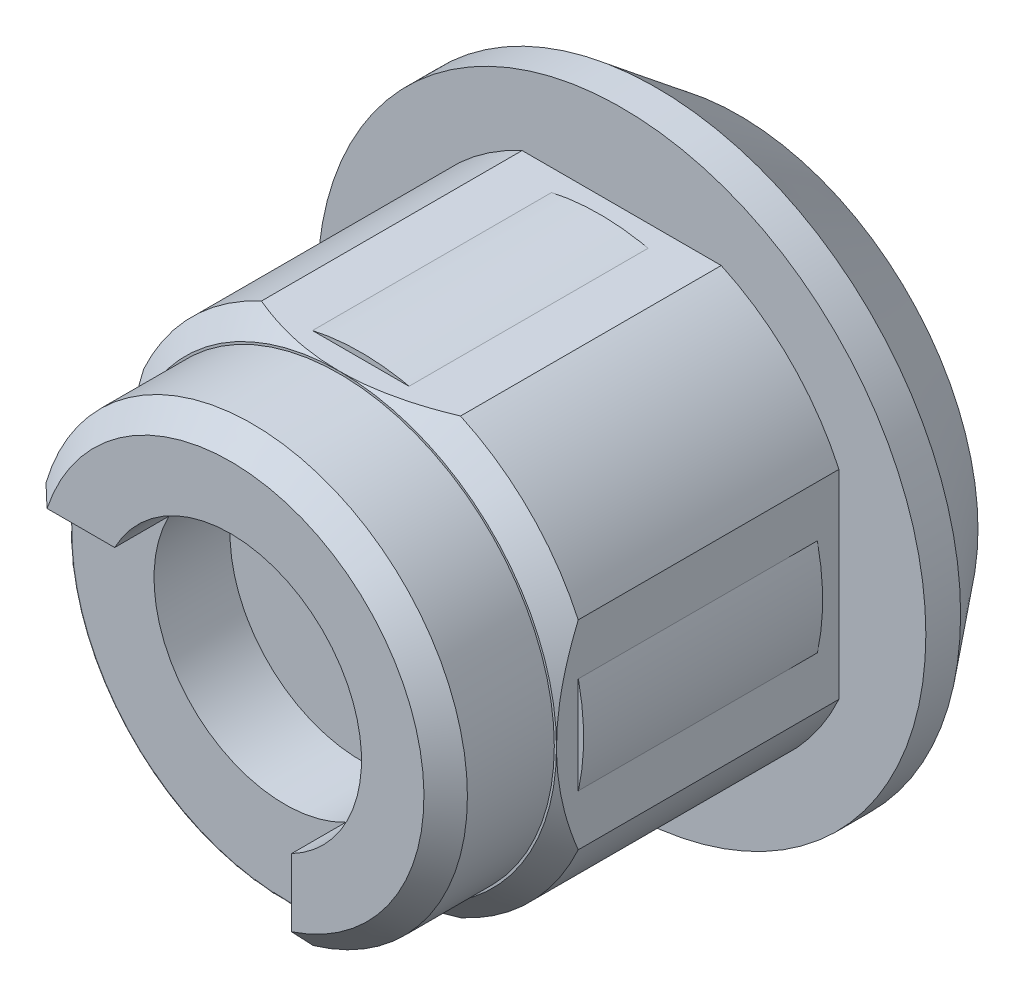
ISO-10303-21;
HEADER;
FILE_DESCRIPTION(('STEP AP214'),'2;1');
FILE_NAME('part.step','',(''),(''),'','','');
FILE_SCHEMA(('AUTOMOTIVE_DESIGN { 1 0 10303 214 1 1 1 1 }'));
ENDSEC;
DATA;
#1=APPLICATION_CONTEXT('core data for automotive mechanical design processes');
#2=APPLICATION_PROTOCOL_DEFINITION('international standard','automotive_design',2000,#1);
#3=PRODUCT_CONTEXT('',#1,'mechanical');
#4=PRODUCT('Part','Part','',(#3));
#5=PRODUCT_RELATED_PRODUCT_CATEGORY('part','',(#4));
#6=PRODUCT_DEFINITION_FORMATION('','',#4);
#7=PRODUCT_DEFINITION_CONTEXT('part definition',#1,'design');
#8=PRODUCT_DEFINITION('design','',#6,#7);
#9=PRODUCT_DEFINITION_SHAPE('','',#8);
#10=(LENGTH_UNIT() NAMED_UNIT(*) SI_UNIT(.MILLI.,.METRE.));
#11=(NAMED_UNIT(*) PLANE_ANGLE_UNIT() SI_UNIT($,.RADIAN.));
#12=(NAMED_UNIT(*) SI_UNIT($,.STERADIAN.) SOLID_ANGLE_UNIT());
#13=UNCERTAINTY_MEASURE_WITH_UNIT(LENGTH_MEASURE(1.E-05),#10,'distance_accuracy_value','');
#14=(GEOMETRIC_REPRESENTATION_CONTEXT(3) GLOBAL_UNCERTAINTY_ASSIGNED_CONTEXT((#13)) GLOBAL_UNIT_ASSIGNED_CONTEXT((#10,
#11,#12)) REPRESENTATION_CONTEXT('',''));
#15=CARTESIAN_POINT('',(0.,0.,0.));
#16=DIRECTION('',(0.,0.,1.));
#17=DIRECTION('',(1.,0.,0.));
#18=AXIS2_PLACEMENT_3D('',#15,#16,#17);
#19=CARTESIAN_POINT('',(0.,0.,17.3999999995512));
#20=DIRECTION('',(0.,0.,-1.));
#21=DIRECTION('',(-1.,0.,0.));
#22=AXIS2_PLACEMENT_3D('',#19,#20,#21);
#23=CONICAL_SURFACE('',#22,10.9999999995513,0.785398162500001);
#24=CARTESIAN_POINT('',(0.,0.,17.4));
#25=DIRECTION('',(0.,0.,1.));
#26=DIRECTION('',(1.,0.,0.));
#27=AXIS2_PLACEMENT_3D('',#24,#25,#26);
#28=CIRCLE('',#27,11.);
#29=CARTESIAN_POINT('',(4.58257569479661,10.,17.3999999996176));
#30=VERTEX_POINT('',#29);
#31=CARTESIAN_POINT('',(10.,4.58257569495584,17.3999999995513));
#32=VERTEX_POINT('',#31);
#33=EDGE_CURVE('P0_E252',#30,#32,#28,.F.);
#34=ORIENTED_EDGE('',*,*,#33,.F.);
#35=CARTESIAN_POINT('',(4.58257569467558,10.000000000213,17.3999999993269));
#36=CARTESIAN_POINT('',(4.40028329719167,10.0000000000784,17.4759299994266));
#37=CARTESIAN_POINT('',(4.21668434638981,10.0000000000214,17.5486818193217));
#38=CARTESIAN_POINT('',(3.84668711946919,9.99999999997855,17.6870431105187));
#39=CARTESIAN_POINT('',(3.66028713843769,9.99999999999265,17.7526480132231));
#40=CARTESIAN_POINT('',(3.10086162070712,10.0000000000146,17.9361412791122));
#41=CARTESIAN_POINT('',(2.72381902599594,10.0000000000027,18.0423213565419));
#42=CARTESIAN_POINT('',(2.15145029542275,9.99999999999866,18.1728762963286));
#43=CARTESIAN_POINT('',(1.95932775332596,9.99999999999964,18.2116334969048));
#44=CARTESIAN_POINT('',(1.57326186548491,10.0000000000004,18.2787828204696));
#45=CARTESIAN_POINT('',(1.37931860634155,10.0000000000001,18.3071754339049));
#46=CARTESIAN_POINT('',(0.988206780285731,9.9999999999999,18.3531827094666));
#47=CARTESIAN_POINT('',(0.791025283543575,9.99999999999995,18.3706880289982));
#48=CARTESIAN_POINT('',(0.395902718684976,10.0000000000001,18.394122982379));
#49=CARTESIAN_POINT('',(0.197961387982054,10.0000000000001,18.4000481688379));
#50=CARTESIAN_POINT('',(8.01662301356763E-12,10.,18.4000000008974));
#51=B_SPLINE_CURVE_WITH_KNOTS('',3,(#35,#36,#37,#38,#39,#40,#41,#42,#43,#44,#45,#46,#47,#48,#49,
#50),.UNSPECIFIED.,.F.,.F.,(4,2,2,2,2,2,2,4),(0.,0.592342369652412,1.18506119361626,
2.35817128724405,2.94592281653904,3.53364653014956,4.12718135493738,4.72094408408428),.UNSPECIFIED.);
#52=CARTESIAN_POINT('',(0.,10.0000000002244,18.4000000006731));
#53=VERTEX_POINT('',#52);
#54=EDGE_CURVE('P0_E269',#30,#53,#51,.T.);
#55=ORIENTED_EDGE('',*,*,#54,.T.);
#56=CARTESIAN_POINT('',(0.,0.,18.4000000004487));
#57=DIRECTION('',(0.,0.,-1.));
#58=DIRECTION('',(-1.,0.,0.));
#59=AXIS2_PLACEMENT_3D('',#56,#57,#58);
#60=CIRCLE('',#59,10.0000000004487);
#61=CARTESIAN_POINT('',(10.0000000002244,0.,18.4000000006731));
#62=VERTEX_POINT('',#61);
#63=EDGE_CURVE('P0_E267',#62,#53,#60,.F.);
#64=ORIENTED_EDGE('',*,*,#63,.F.);
#65=CARTESIAN_POINT('',(9.99999999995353,0.,18.4000000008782));
#66=CARTESIAN_POINT('',(9.99999999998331,0.153419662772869,18.4000177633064));
#67=CARTESIAN_POINT('',(9.99999999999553,0.306833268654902,18.3964698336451));
#68=CARTESIAN_POINT('',(10.0000000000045,0.613315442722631,18.3823745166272));
#69=CARTESIAN_POINT('',(10.0000000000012,0.766384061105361,18.3718282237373));
#70=CARTESIAN_POINT('',(9.9999999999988,1.07166096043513,18.3438891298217));
#71=CARTESIAN_POINT('',(9.99999999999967,1.22387019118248,18.3265066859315));
#72=CARTESIAN_POINT('',(10.0000000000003,1.52738320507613,18.2851453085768));
#73=CARTESIAN_POINT('',(10.0000000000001,1.67868696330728,18.2611661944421));
#74=CARTESIAN_POINT('',(9.99999999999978,2.12685071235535,18.1805087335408));
#75=CARTESIAN_POINT('',(9.99999999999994,2.42210425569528,18.1147147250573));
#76=CARTESIAN_POINT('',(10.0000000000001,3.0068849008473,17.9615326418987));
#77=CARTESIAN_POINT('',(10.,3.29641147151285,17.8741425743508));
#78=CARTESIAN_POINT('',(9.99999999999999,3.75125759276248,17.72073206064));
#79=CARTESIAN_POINT('',(10.,3.91864293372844,17.6607244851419));
#80=CARTESIAN_POINT('',(10.,4.25191341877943,17.5346928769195));
#81=CARTESIAN_POINT('',(10.,4.41778971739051,17.4686454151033));
#82=CARTESIAN_POINT('',(10.,4.58257569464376,17.3999999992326));
#83=B_SPLINE_CURVE_WITH_KNOTS('',3,(#65,#66,#67,#68,#69,#70,#71,#72,#73,#74,#75,#76,#77,#78,#79,
#80,#81,#82),.UNSPECIFIED.,.F.,.F.,(4,2,2,2,2,2,2,2,4),(0.,0.46020793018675,0.920343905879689,
1.37978541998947,1.83923951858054,2.74570852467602,3.65226121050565,4.18561484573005,
4.72113306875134),.UNSPECIFIED.);
#84=EDGE_CURVE('P0_E19',#62,#32,#83,.T.);
#85=ORIENTED_EDGE('',*,*,#84,.T.);
#86=EDGE_LOOP('',(#34,#55,#64,#85));
#87=FACE_BOUND('',#86,.T.);
#88=ADVANCED_FACE('P0_F15',(#87),#23,.T.);
#89=CARTESIAN_POINT('',(0.,0.,17.3999999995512));
#90=DIRECTION('',(0.,0.,-1.));
#91=DIRECTION('',(-1.,0.,0.));
#92=AXIS2_PLACEMENT_3D('',#89,#90,#91);
#93=CONICAL_SURFACE('',#92,10.9999999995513,0.785398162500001);
#94=CARTESIAN_POINT('',(0.,0.,18.4000000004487));
#95=DIRECTION('',(0.,0.,-1.));
#96=DIRECTION('',(-1.,0.,0.));
#97=AXIS2_PLACEMENT_3D('',#94,#95,#96);
#98=CIRCLE('',#97,10.0000000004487);
#99=CARTESIAN_POINT('',(-10.0000000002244,0.,18.4000000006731));
#100=VERTEX_POINT('',#99);
#101=EDGE_CURVE('P0_E272',#53,#100,#98,.F.);
#102=ORIENTED_EDGE('',*,*,#101,.F.);
#103=CARTESIAN_POINT('',(0.,9.99999999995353,18.4000000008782));
#104=CARTESIAN_POINT('',(-0.153419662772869,9.99999999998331,18.4000177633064));
#105=CARTESIAN_POINT('',(-0.306833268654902,9.99999999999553,18.3964698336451));
#106=CARTESIAN_POINT('',(-0.613315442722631,10.0000000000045,18.3823745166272));
#107=CARTESIAN_POINT('',(-0.766384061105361,10.0000000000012,18.3718282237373));
#108=CARTESIAN_POINT('',(-1.07166096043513,9.9999999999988,18.3438891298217));
#109=CARTESIAN_POINT('',(-1.22387019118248,9.99999999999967,18.3265066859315));
#110=CARTESIAN_POINT('',(-1.52738320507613,10.0000000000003,18.2851453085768));
#111=CARTESIAN_POINT('',(-1.67868696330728,10.0000000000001,18.2611661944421));
#112=CARTESIAN_POINT('',(-2.12685071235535,9.99999999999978,18.1805087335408));
#113=CARTESIAN_POINT('',(-2.42210425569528,9.99999999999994,18.1147147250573));
#114=CARTESIAN_POINT('',(-3.0068849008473,10.0000000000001,17.9615326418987));
#115=CARTESIAN_POINT('',(-3.29641147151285,10.,17.8741425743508));
#116=CARTESIAN_POINT('',(-3.75125759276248,9.99999999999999,17.72073206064));
#117=CARTESIAN_POINT('',(-3.91864293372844,10.,17.6607244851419));
#118=CARTESIAN_POINT('',(-4.25191341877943,10.,17.5346928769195));
#119=CARTESIAN_POINT('',(-4.41778971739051,10.,17.4686454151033));
#120=CARTESIAN_POINT('',(-4.58257569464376,10.,17.3999999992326));
#121=B_SPLINE_CURVE_WITH_KNOTS('',3,(#103,#104,#105,#106,#107,#108,#109,#110,#111,#112,#113,
#114,#115,#116,#117,#118,#119,#120),.UNSPECIFIED.,.F.,.F.,(4,2,2,2,2,2,2,2,4),(0.,
0.46020793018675,0.920343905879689,1.37978541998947,1.83923951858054,2.74570852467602,
3.65226121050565,4.18561484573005,4.72113306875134),.UNSPECIFIED.);
#122=CARTESIAN_POINT('',(-4.58257569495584,10.,17.3999999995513));
#123=VERTEX_POINT('',#122);
#124=EDGE_CURVE('P0_E988',#53,#123,#121,.T.);
#125=ORIENTED_EDGE('',*,*,#124,.T.);
#126=CARTESIAN_POINT('',(0.,0.,17.4));
#127=DIRECTION('',(0.,0.,1.));
#128=DIRECTION('',(1.,0.,0.));
#129=AXIS2_PLACEMENT_3D('',#126,#127,#128);
#130=CIRCLE('',#129,11.);
#131=CARTESIAN_POINT('',(-10.,4.58257569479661,17.3999999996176));
#132=VERTEX_POINT('',#131);
#133=EDGE_CURVE('P0_E604',#132,#123,#130,.F.);
#134=ORIENTED_EDGE('',*,*,#133,.F.);
#135=CARTESIAN_POINT('',(-10.000000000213,4.58257569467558,17.3999999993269));
#136=CARTESIAN_POINT('',(-10.0000000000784,4.40028329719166,17.4759299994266));
#137=CARTESIAN_POINT('',(-10.0000000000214,4.21668434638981,17.5486818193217));
#138=CARTESIAN_POINT('',(-9.99999999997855,3.84668711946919,17.6870431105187));
#139=CARTESIAN_POINT('',(-9.99999999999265,3.66028713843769,17.7526480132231));
#140=CARTESIAN_POINT('',(-10.0000000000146,3.10086162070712,17.9361412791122));
#141=CARTESIAN_POINT('',(-10.0000000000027,2.72381902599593,18.0423213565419));
#142=CARTESIAN_POINT('',(-9.99999999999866,2.15145029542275,18.1728762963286));
#143=CARTESIAN_POINT('',(-9.99999999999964,1.95932775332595,18.2116334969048));
#144=CARTESIAN_POINT('',(-10.0000000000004,1.5732618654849,18.2787828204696));
#145=CARTESIAN_POINT('',(-10.0000000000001,1.37931860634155,18.3071754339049));
#146=CARTESIAN_POINT('',(-9.9999999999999,0.98820678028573,18.3531827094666));
#147=CARTESIAN_POINT('',(-9.99999999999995,0.791025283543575,18.3706880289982));
#148=CARTESIAN_POINT('',(-10.0000000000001,0.395902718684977,18.394122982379));
#149=CARTESIAN_POINT('',(-10.0000000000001,0.197961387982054,18.4000481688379));
#150=CARTESIAN_POINT('',(-10.,8.0167869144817E-12,18.4000000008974));
#151=B_SPLINE_CURVE_WITH_KNOTS('',3,(#135,#136,#137,#138,#139,#140,#141,#142,#143,#144,#145,
#146,#147,#148,#149,#150),.UNSPECIFIED.,.F.,.F.,(4,2,2,2,2,2,2,4),(0.,0.592342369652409,
1.18506119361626,2.35817128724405,2.94592281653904,3.53364653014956,4.12718135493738,
4.72094408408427),.UNSPECIFIED.);
#152=EDGE_CURVE('P0_E597',#132,#100,#151,.T.);
#153=ORIENTED_EDGE('',*,*,#152,.T.);
#154=EDGE_LOOP('',(#102,#125,#134,#153));
#155=FACE_BOUND('',#154,.T.);
#156=ADVANCED_FACE('P0_F314',(#155),#93,.T.);
#157=CARTESIAN_POINT('',(0.,0.,17.3999999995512));
#158=DIRECTION('',(0.,0.,-1.));
#159=DIRECTION('',(-1.,0.,0.));
#160=AXIS2_PLACEMENT_3D('',#157,#158,#159);
#161=CONICAL_SURFACE('',#160,10.9999999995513,0.785398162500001);
#162=CARTESIAN_POINT('',(0.,0.,17.4));
#163=DIRECTION('',(0.,0.,1.));
#164=DIRECTION('',(1.,0.,0.));
#165=AXIS2_PLACEMENT_3D('',#162,#163,#164);
#166=CIRCLE('',#165,11.);
#167=CARTESIAN_POINT('',(-4.58257569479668,-9.99999999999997,17.3999999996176));
#168=VERTEX_POINT('',#167);
#169=CARTESIAN_POINT('',(-10.,-4.58257569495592,17.3999999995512));
#170=VERTEX_POINT('',#169);
#171=EDGE_CURVE('P0_E329',#168,#170,#166,.F.);
#172=ORIENTED_EDGE('',*,*,#171,.F.);
#173=CARTESIAN_POINT('',(-4.58257569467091,-10.000000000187,17.3999999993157));
#174=CARTESIAN_POINT('',(-4.40028329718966,-10.0000000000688,17.4759299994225));
#175=CARTESIAN_POINT('',(-4.21668434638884,-10.0000000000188,17.5486818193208));
#176=CARTESIAN_POINT('',(-3.84668711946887,-9.99999999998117,17.6870431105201));
#177=CARTESIAN_POINT('',(-3.66028713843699,-9.99999999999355,17.7526480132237));
#178=CARTESIAN_POINT('',(-3.10086162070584,-10.0000000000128,17.9361412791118));
#179=CARTESIAN_POINT('',(-2.72381902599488,-10.0000000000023,18.042321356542));
#180=CARTESIAN_POINT('',(-2.15145029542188,-9.99999999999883,18.1728762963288));
#181=CARTESIAN_POINT('',(-1.95932775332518,-9.99999999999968,18.2116334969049));
#182=CARTESIAN_POINT('',(-1.57326186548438,-10.0000000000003,18.2787828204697));
#183=CARTESIAN_POINT('',(-1.37931860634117,-10.0000000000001,18.3071754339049));
#184=CARTESIAN_POINT('',(-0.988206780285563,-9.99999999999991,18.3531827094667));
#185=CARTESIAN_POINT('',(-0.791025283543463,-9.99999999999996,18.3706880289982));
#186=CARTESIAN_POINT('',(-0.395902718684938,-10.,18.394122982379));
#187=CARTESIAN_POINT('',(-0.197961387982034,-10.0000000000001,18.4000481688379));
#188=CARTESIAN_POINT('',(-8.01905768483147E-12,-10.,18.4000000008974));
#189=B_SPLINE_CURVE_WITH_KNOTS('',3,(#173,#174,#175,#176,#177,#178,#179,#180,#181,#182,#183,
#184,#185,#186,#187,#188),.UNSPECIFIED.,.F.,.F.,(4,2,2,2,2,2,2,4),(0.,0.592342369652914,
1.18506119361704,2.35817128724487,2.94592281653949,3.53364653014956,4.12718135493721,
4.72094408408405),.UNSPECIFIED.);
#190=CARTESIAN_POINT('',(0.,-10.0000000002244,18.4000000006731));
#191=VERTEX_POINT('',#190);
#192=EDGE_CURVE('P0_E325',#168,#191,#189,.T.);
#193=ORIENTED_EDGE('',*,*,#192,.T.);
#194=CARTESIAN_POINT('',(0.,0.,18.4000000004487));
#195=DIRECTION('',(0.,0.,-1.));
#196=DIRECTION('',(-1.,0.,0.));
#197=AXIS2_PLACEMENT_3D('',#194,#195,#196);
#198=CIRCLE('',#197,10.0000000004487);
#199=EDGE_CURVE('P0_E280',#100,#191,#198,.F.);
#200=ORIENTED_EDGE('',*,*,#199,.F.);
#201=CARTESIAN_POINT('',(-9.99999999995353,0.,18.4000000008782));
#202=CARTESIAN_POINT('',(-9.99999999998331,-0.153419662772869,18.4000177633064));
#203=CARTESIAN_POINT('',(-9.99999999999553,-0.306833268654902,18.3964698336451));
#204=CARTESIAN_POINT('',(-10.0000000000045,-0.613315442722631,18.3823745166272));
#205=CARTESIAN_POINT('',(-10.0000000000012,-0.766384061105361,18.3718282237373));
#206=CARTESIAN_POINT('',(-9.9999999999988,-1.07166096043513,18.3438891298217));
#207=CARTESIAN_POINT('',(-9.99999999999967,-1.22387019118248,18.3265066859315));
#208=CARTESIAN_POINT('',(-10.0000000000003,-1.52738320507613,18.2851453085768));
#209=CARTESIAN_POINT('',(-10.0000000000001,-1.67868696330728,18.2611661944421));
#210=CARTESIAN_POINT('',(-9.99999999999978,-2.12685071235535,18.1805087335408));
#211=CARTESIAN_POINT('',(-9.99999999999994,-2.42210425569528,18.1147147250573));
#212=CARTESIAN_POINT('',(-10.0000000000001,-3.00688490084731,17.9615326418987));
#213=CARTESIAN_POINT('',(-10.,-3.29641147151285,17.8741425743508));
#214=CARTESIAN_POINT('',(-9.99999999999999,-3.75125759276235,17.7207320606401));
#215=CARTESIAN_POINT('',(-10.,-3.91864293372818,17.660724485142));
#216=CARTESIAN_POINT('',(-10.,-4.25191341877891,17.5346928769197));
#217=CARTESIAN_POINT('',(-10.,-4.41778971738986,17.4686454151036));
#218=CARTESIAN_POINT('',(-10.,-4.58257569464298,17.3999999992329));
#219=B_SPLINE_CURVE_WITH_KNOTS('',3,(#201,#202,#203,#204,#205,#206,#207,#208,#209,#210,#211,
#212,#213,#214,#215,#216,#217,#218),.UNSPECIFIED.,.F.,.F.,(4,2,2,2,2,2,2,2,4),(0.,
0.460207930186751,0.920343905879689,1.37978541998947,1.83923951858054,2.74570852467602,
3.65226121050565,4.18561484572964,4.72113306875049),.UNSPECIFIED.);
#220=EDGE_CURVE('P0_E319',#100,#170,#219,.T.);
#221=ORIENTED_EDGE('',*,*,#220,.T.);
#222=EDGE_LOOP('',(#172,#193,#200,#221));
#223=FACE_BOUND('',#222,.T.);
#224=ADVANCED_FACE('P0_F310',(#223),#161,.T.);
#225=CARTESIAN_POINT('',(0.,0.,17.3999999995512));
#226=DIRECTION('',(0.,0.,-1.));
#227=DIRECTION('',(-1.,0.,0.));
#228=AXIS2_PLACEMENT_3D('',#225,#226,#227);
#229=CONICAL_SURFACE('',#228,10.9999999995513,0.785398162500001);
#230=CARTESIAN_POINT('',(0.,0.,18.4000000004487));
#231=DIRECTION('',(0.,0.,-1.));
#232=DIRECTION('',(-1.,0.,0.));
#233=AXIS2_PLACEMENT_3D('',#230,#231,#232);
#234=CIRCLE('',#233,10.0000000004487);
#235=EDGE_CURVE('P0_E276',#191,#62,#234,.F.);
#236=ORIENTED_EDGE('',*,*,#235,.F.);
#237=CARTESIAN_POINT('',(0.,-9.99999999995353,18.4000000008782));
#238=CARTESIAN_POINT('',(0.15341966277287,-9.99999999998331,18.4000177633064));
#239=CARTESIAN_POINT('',(0.306833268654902,-9.99999999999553,18.3964698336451));
#240=CARTESIAN_POINT('',(0.613315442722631,-10.0000000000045,18.3823745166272));
#241=CARTESIAN_POINT('',(0.766384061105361,-10.0000000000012,18.3718282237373));
#242=CARTESIAN_POINT('',(1.07166096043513,-9.9999999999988,18.3438891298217));
#243=CARTESIAN_POINT('',(1.22387019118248,-9.99999999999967,18.3265066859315));
#244=CARTESIAN_POINT('',(1.52738320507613,-10.0000000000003,18.2851453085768));
#245=CARTESIAN_POINT('',(1.67868696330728,-10.0000000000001,18.2611661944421));
#246=CARTESIAN_POINT('',(2.12685071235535,-9.99999999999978,18.1805087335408));
#247=CARTESIAN_POINT('',(2.42210425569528,-9.99999999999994,18.1147147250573));
#248=CARTESIAN_POINT('',(3.00688490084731,-10.0000000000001,17.9615326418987));
#249=CARTESIAN_POINT('',(3.29641147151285,-10.,17.8741425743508));
#250=CARTESIAN_POINT('',(3.75125759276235,-9.99999999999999,17.7207320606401));
#251=CARTESIAN_POINT('',(3.91864293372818,-10.,17.660724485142));
#252=CARTESIAN_POINT('',(4.25191341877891,-10.,17.5346928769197));
#253=CARTESIAN_POINT('',(4.41778971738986,-10.,17.4686454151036));
#254=CARTESIAN_POINT('',(4.58257569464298,-10.,17.3999999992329));
#255=B_SPLINE_CURVE_WITH_KNOTS('',3,(#237,#238,#239,#240,#241,#242,#243,#244,#245,#246,#247,
#248,#249,#250,#251,#252,#253,#254),.UNSPECIFIED.,.F.,.F.,(4,2,2,2,2,2,2,2,4),(0.,
0.46020793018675,0.920343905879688,1.37978541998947,1.83923951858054,2.74570852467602,
3.65226121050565,4.18561484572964,4.72113306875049),.UNSPECIFIED.);
#256=CARTESIAN_POINT('',(4.58257569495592,-10.,17.3999999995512));
#257=VERTEX_POINT('',#256);
#258=EDGE_CURVE('P0_E298',#191,#257,#255,.T.);
#259=ORIENTED_EDGE('',*,*,#258,.T.);
#260=CARTESIAN_POINT('',(0.,0.,17.4));
#261=DIRECTION('',(0.,0.,1.));
#262=DIRECTION('',(1.,0.,0.));
#263=AXIS2_PLACEMENT_3D('',#260,#261,#262);
#264=CIRCLE('',#263,11.);
#265=CARTESIAN_POINT('',(9.99999999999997,-4.58257569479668,17.3999999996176));
#266=VERTEX_POINT('',#265);
#267=EDGE_CURVE('P0_E288',#266,#257,#264,.F.);
#268=ORIENTED_EDGE('',*,*,#267,.F.);
#269=CARTESIAN_POINT('',(10.000000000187,-4.58257569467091,17.3999999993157));
#270=CARTESIAN_POINT('',(10.0000000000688,-4.40028329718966,17.4759299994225));
#271=CARTESIAN_POINT('',(10.0000000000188,-4.21668434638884,17.5486818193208));
#272=CARTESIAN_POINT('',(9.99999999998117,-3.84668711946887,17.6870431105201));
#273=CARTESIAN_POINT('',(9.99999999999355,-3.66028713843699,17.7526480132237));
#274=CARTESIAN_POINT('',(10.0000000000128,-3.10086162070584,17.9361412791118));
#275=CARTESIAN_POINT('',(10.0000000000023,-2.72381902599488,18.042321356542));
#276=CARTESIAN_POINT('',(9.99999999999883,-2.15145029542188,18.1728762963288));
#277=CARTESIAN_POINT('',(9.99999999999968,-1.95932775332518,18.2116334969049));
#278=CARTESIAN_POINT('',(10.0000000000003,-1.57326186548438,18.2787828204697));
#279=CARTESIAN_POINT('',(10.0000000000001,-1.37931860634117,18.3071754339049));
#280=CARTESIAN_POINT('',(9.99999999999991,-0.988206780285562,18.3531827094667));
#281=CARTESIAN_POINT('',(9.99999999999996,-0.791025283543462,18.3706880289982));
#282=CARTESIAN_POINT('',(10.,-0.395902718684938,18.394122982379));
#283=CARTESIAN_POINT('',(10.0000000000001,-0.197961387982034,18.4000481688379));
#284=CARTESIAN_POINT('',(10.,-8.01905768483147E-12,18.4000000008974));
#285=B_SPLINE_CURVE_WITH_KNOTS('',3,(#269,#270,#271,#272,#273,#274,#275,#276,#277,#278,#279,
#280,#281,#282,#283,#284),.UNSPECIFIED.,.F.,.F.,(4,2,2,2,2,2,2,4),(0.,0.592342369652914,
1.18506119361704,2.35817128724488,2.94592281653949,3.53364653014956,4.12718135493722,
4.72094408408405),.UNSPECIFIED.);
#286=EDGE_CURVE('P0_E265',#266,#62,#285,.T.);
#287=ORIENTED_EDGE('',*,*,#286,.T.);
#288=EDGE_LOOP('',(#236,#259,#268,#287));
#289=FACE_BOUND('',#288,.T.);
#290=ADVANCED_FACE('P0_F287',(#289),#229,.T.);
#291=CARTESIAN_POINT('',(0.,0.,-1.17));
#292=DIRECTION('',(0.,0.,1.));
#293=DIRECTION('',(1.,0.,0.));
#294=AXIS2_PLACEMENT_3D('',#291,#292,#293);
#295=CYLINDRICAL_SURFACE('',#294,11.);
#296=CARTESIAN_POINT('',(0.,0.,5.4));
#297=DIRECTION('',(0.,0.,1.));
#298=DIRECTION('',(1.,0.,0.));
#299=AXIS2_PLACEMENT_3D('',#296,#297,#298);
#300=CIRCLE('',#299,11.);
#301=CARTESIAN_POINT('',(4.58257895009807,10.,5.4));
#302=VERTEX_POINT('',#301);
#303=CARTESIAN_POINT('',(10.0000014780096,4.58257246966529,5.4));
#304=VERTEX_POINT('',#303);
#305=EDGE_CURVE('P0_E284',#302,#304,#300,.F.);
#306=ORIENTED_EDGE('',*,*,#305,.F.);
#307=DIRECTION('',(0.,0.,1.));
#308=VECTOR('',#307,1.);
#309=CARTESIAN_POINT('',(4.58257569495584,10.,5.4));
#310=LINE('',#309,#308);
#311=EDGE_CURVE('P0_E257',#302,#30,#310,.T.);
#312=ORIENTED_EDGE('',*,*,#311,.T.);
#313=ORIENTED_EDGE('',*,*,#33,.T.);
#314=DIRECTION('',(0.,0.,1.));
#315=VECTOR('',#314,1.);
#316=CARTESIAN_POINT('',(10.,4.58257569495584,17.3999999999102));
#317=LINE('',#316,#315);
#318=EDGE_CURVE('P0_E255',#32,#304,#317,.F.);
#319=ORIENTED_EDGE('',*,*,#318,.T.);
#320=EDGE_LOOP('',(#306,#312,#313,#319));
#321=FACE_BOUND('',#320,.T.);
#322=ADVANCED_FACE('P0_F254',(#321),#295,.T.);
#323=CARTESIAN_POINT('',(10.,4.582575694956,23.4));
#324=DIRECTION('',(-1.,0.,0.));
#325=DIRECTION('',(0.,0.,1.));
#326=AXIS2_PLACEMENT_3D('',#323,#324,#325);
#327=PLANE('',#326);
#328=DIRECTION('',(0.,0.,1.));
#329=VECTOR('',#328,1.);
#330=CARTESIAN_POINT('',(9.99999999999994,-4.58257569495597,-1.17));
#331=LINE('',#330,#329);
#332=CARTESIAN_POINT('',(9.99999999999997,-4.5825756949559,5.4));
#333=VERTEX_POINT('',#332);
#334=EDGE_CURVE('P0_E291',#333,#266,#331,.T.);
#335=ORIENTED_EDGE('',*,*,#334,.F.);
#336=DIRECTION('',(0.,-1.,0.));
#337=VECTOR('',#336,1.);
#338=CARTESIAN_POINT('',(10.,0.,5.4));
#339=LINE('',#338,#337);
#340=EDGE_CURVE('P0_E264',#304,#333,#339,.T.);
#341=ORIENTED_EDGE('',*,*,#340,.F.);
#342=ORIENTED_EDGE('',*,*,#318,.F.);
#343=ORIENTED_EDGE('',*,*,#84,.F.);
#344=ORIENTED_EDGE('',*,*,#286,.F.);
#345=EDGE_LOOP('',(#335,#341,#342,#343,#344));
#346=FACE_BOUND('',#345,.T.);
#347=ADVANCED_FACE('P0_F263',(#346),#327,.F.);
#348=CARTESIAN_POINT('',(0.,0.,-1.17));
#349=DIRECTION('',(0.,0.,1.));
#350=DIRECTION('',(1.,0.,0.));
#351=AXIS2_PLACEMENT_3D('',#348,#349,#350);
#352=CYLINDRICAL_SURFACE('',#351,11.);
#353=CARTESIAN_POINT('',(0.,0.,5.4));
#354=DIRECTION('',(0.,0.,1.));
#355=DIRECTION('',(1.,0.,0.));
#356=AXIS2_PLACEMENT_3D('',#353,#354,#355);
#357=CIRCLE('',#356,11.);
#358=CARTESIAN_POINT('',(4.58257569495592,-10.,5.4));
#359=VERTEX_POINT('',#358);
#360=EDGE_CURVE('P0_E593',#333,#359,#357,.F.);
#361=ORIENTED_EDGE('',*,*,#360,.F.);
#362=ORIENTED_EDGE('',*,*,#334,.T.);
#363=ORIENTED_EDGE('',*,*,#267,.T.);
#364=DIRECTION('',(0.,0.,1.));
#365=VECTOR('',#364,1.);
#366=CARTESIAN_POINT('',(4.582575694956,-10.,23.4));
#367=LINE('',#366,#365);
#368=EDGE_CURVE('P0_E330',#257,#359,#367,.F.);
#369=ORIENTED_EDGE('',*,*,#368,.T.);
#370=EDGE_LOOP('',(#361,#362,#363,#369));
#371=FACE_BOUND('',#370,.T.);
#372=ADVANCED_FACE('P0_F336',(#371),#352,.T.);
#373=CARTESIAN_POINT('',(4.582575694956,-10.,23.4));
#374=DIRECTION('',(0.,1.,0.));
#375=DIRECTION('',(0.,0.,1.));
#376=AXIS2_PLACEMENT_3D('',#373,#374,#375);
#377=PLANE('',#376);
#378=DIRECTION('',(0.,0.,1.));
#379=VECTOR('',#378,1.);
#380=CARTESIAN_POINT('',(-4.58257569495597,-9.99999999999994,-1.17));
#381=LINE('',#380,#379);
#382=CARTESIAN_POINT('',(-4.5825756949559,-9.99999999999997,5.4));
#383=VERTEX_POINT('',#382);
#384=EDGE_CURVE('P0_E598',#383,#168,#381,.T.);
#385=ORIENTED_EDGE('',*,*,#384,.F.);
#386=DIRECTION('',(1.,0.,0.));
#387=VECTOR('',#386,1.);
#388=CARTESIAN_POINT('',(0.,-10.,5.4));
#389=LINE('',#388,#387);
#390=EDGE_CURVE('P0_E590',#359,#383,#389,.F.);
#391=ORIENTED_EDGE('',*,*,#390,.F.);
#392=ORIENTED_EDGE('',*,*,#368,.F.);
#393=ORIENTED_EDGE('',*,*,#258,.F.);
#394=ORIENTED_EDGE('',*,*,#192,.F.);
#395=EDGE_LOOP('',(#385,#391,#392,#393,#394));
#396=FACE_BOUND('',#395,.T.);
#397=ADVANCED_FACE('P0_F331',(#396),#377,.F.);
#398=CARTESIAN_POINT('',(0.,0.,-1.17));
#399=DIRECTION('',(0.,0.,1.));
#400=DIRECTION('',(1.,0.,0.));
#401=AXIS2_PLACEMENT_3D('',#398,#399,#400);
#402=CYLINDRICAL_SURFACE('',#401,11.);
#403=CARTESIAN_POINT('',(0.,0.,5.4));
#404=DIRECTION('',(0.,0.,1.));
#405=DIRECTION('',(1.,0.,0.));
#406=AXIS2_PLACEMENT_3D('',#403,#404,#405);
#407=CIRCLE('',#406,11.);
#408=CARTESIAN_POINT('',(-10.,-4.58257569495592,5.4));
#409=VERTEX_POINT('',#408);
#410=EDGE_CURVE('P0_E592',#383,#409,#407,.F.);
#411=ORIENTED_EDGE('',*,*,#410,.F.);
#412=ORIENTED_EDGE('',*,*,#384,.T.);
#413=ORIENTED_EDGE('',*,*,#171,.T.);
#414=DIRECTION('',(0.,0.,-1.));
#415=VECTOR('',#414,1.);
#416=CARTESIAN_POINT('',(-10.,-4.582575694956,23.4));
#417=LINE('',#416,#415);
#418=EDGE_CURVE('P0_E594',#170,#409,#417,.T.);
#419=ORIENTED_EDGE('',*,*,#418,.T.);
#420=EDGE_LOOP('',(#411,#412,#413,#419));
#421=FACE_BOUND('',#420,.T.);
#422=ADVANCED_FACE('P0_F335',(#421),#402,.T.);
#423=CARTESIAN_POINT('',(-10.,-4.582575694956,23.4));
#424=DIRECTION('',(1.,0.,0.));
#425=DIRECTION('',(0.,0.,-1.));
#426=AXIS2_PLACEMENT_3D('',#423,#424,#425);
#427=PLANE('',#426);
#428=DIRECTION('',(0.,0.,1.));
#429=VECTOR('',#428,1.);
#430=CARTESIAN_POINT('',(-10.,4.58257569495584,5.4));
#431=LINE('',#430,#429);
#432=CARTESIAN_POINT('',(-10.,4.58257246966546,5.4));
#433=VERTEX_POINT('',#432);
#434=EDGE_CURVE('P0_E606',#433,#132,#431,.T.);
#435=ORIENTED_EDGE('',*,*,#434,.F.);
#436=DIRECTION('',(0.,1.,0.));
#437=VECTOR('',#436,1.);
#438=CARTESIAN_POINT('',(-10.,0.,5.4));
#439=LINE('',#438,#437);
#440=EDGE_CURVE('P0_E1018',#409,#433,#439,.T.);
#441=ORIENTED_EDGE('',*,*,#440,.F.);
#442=ORIENTED_EDGE('',*,*,#418,.F.);
#443=ORIENTED_EDGE('',*,*,#220,.F.);
#444=ORIENTED_EDGE('',*,*,#152,.F.);
#445=EDGE_LOOP('',(#435,#441,#442,#443,#444));
#446=FACE_BOUND('',#445,.T.);
#447=ADVANCED_FACE('P0_F812',(#446),#427,.F.);
#448=CARTESIAN_POINT('',(0.,0.,-1.17));
#449=DIRECTION('',(0.,0.,1.));
#450=DIRECTION('',(1.,0.,0.));
#451=AXIS2_PLACEMENT_3D('',#448,#449,#450);
#452=CYLINDRICAL_SURFACE('',#451,11.);
#453=CARTESIAN_POINT('',(0.,0.,5.4));
#454=DIRECTION('',(0.,0.,1.));
#455=DIRECTION('',(1.,0.,0.));
#456=AXIS2_PLACEMENT_3D('',#453,#454,#455);
#457=CIRCLE('',#456,11.);
#458=CARTESIAN_POINT('',(-4.58257895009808,9.99999850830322,5.4));
#459=VERTEX_POINT('',#458);
#460=EDGE_CURVE('P0_E1015',#433,#459,#457,.F.);
#461=ORIENTED_EDGE('',*,*,#460,.F.);
#462=ORIENTED_EDGE('',*,*,#434,.T.);
#463=ORIENTED_EDGE('',*,*,#133,.T.);
#464=DIRECTION('',(0.,0.,1.));
#465=VECTOR('',#464,1.);
#466=CARTESIAN_POINT('',(-4.58257569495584,10.,17.3999999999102));
#467=LINE('',#466,#465);
#468=EDGE_CURVE('P0_E1004',#123,#459,#467,.F.);
#469=ORIENTED_EDGE('',*,*,#468,.T.);
#470=EDGE_LOOP('',(#461,#462,#463,#469));
#471=FACE_BOUND('',#470,.T.);
#472=ADVANCED_FACE('P0_F804',(#471),#452,.T.);
#473=CARTESIAN_POINT('',(-4.582575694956,10.,23.4));
#474=DIRECTION('',(0.,-1.,0.));
#475=DIRECTION('',(0.,0.,-1.));
#476=AXIS2_PLACEMENT_3D('',#473,#474,#475);
#477=PLANE('',#476);
#478=ORIENTED_EDGE('',*,*,#311,.F.);
#479=DIRECTION('',(1.,0.,0.));
#480=VECTOR('',#479,1.);
#481=CARTESIAN_POINT('',(0.,10.,5.4));
#482=LINE('',#481,#480);
#483=EDGE_CURVE('P0_E587',#459,#302,#482,.T.);
#484=ORIENTED_EDGE('',*,*,#483,.F.);
#485=ORIENTED_EDGE('',*,*,#468,.F.);
#486=ORIENTED_EDGE('',*,*,#124,.F.);
#487=ORIENTED_EDGE('',*,*,#54,.F.);
#488=EDGE_LOOP('',(#478,#484,#485,#486,#487));
#489=FACE_BOUND('',#488,.T.);
#490=ADVANCED_FACE('P0_F796',(#489),#477,.F.);
#491=CARTESIAN_POINT('',(0.,0.,18.4));
#492=DIRECTION('',(0.,0.,1.));
#493=DIRECTION('',(1.,0.,0.));
#494=AXIS2_PLACEMENT_3D('',#491,#492,#493);
#495=PLANE('',#494);
#496=CARTESIAN_POINT('',(0.,0.,18.4));
#497=DIRECTION('',(0.,0.,1.));
#498=DIRECTION('',(1.,0.,0.));
#499=AXIS2_PLACEMENT_3D('',#496,#497,#498);
#500=CIRCLE('',#499,9.9);
#501=CARTESIAN_POINT('',(9.9,0.,18.4));
#502=VERTEX_POINT('',#501);
#503=EDGE_CURVE('P0_E589',#502,#502,#500,.T.);
#504=ORIENTED_EDGE('',*,*,#503,.F.);
#505=EDGE_LOOP('',(#504));
#506=FACE_BOUND('',#505,.T.);
#507=ORIENTED_EDGE('',*,*,#199,.T.);
#508=ORIENTED_EDGE('',*,*,#235,.T.);
#509=ORIENTED_EDGE('',*,*,#63,.T.);
#510=ORIENTED_EDGE('',*,*,#101,.T.);
#511=EDGE_LOOP('',(#507,#508,#509,#510));
#512=FACE_BOUND('',#511,.T.);
#513=ADVANCED_FACE('P0_F278',(#506,#512),#495,.T.);
#514=CARTESIAN_POINT('',(0.,0.,5.4));
#515=DIRECTION('',(0.,0.,1.));
#516=DIRECTION('',(1.,0.,0.));
#517=AXIS2_PLACEMENT_3D('',#514,#515,#516);
#518=PLANE('',#517);
#519=ORIENTED_EDGE('',*,*,#460,.T.);
#520=ORIENTED_EDGE('',*,*,#483,.T.);
#521=ORIENTED_EDGE('',*,*,#305,.T.);
#522=ORIENTED_EDGE('',*,*,#340,.T.);
#523=ORIENTED_EDGE('',*,*,#360,.T.);
#524=ORIENTED_EDGE('',*,*,#390,.T.);
#525=ORIENTED_EDGE('',*,*,#410,.T.);
#526=ORIENTED_EDGE('',*,*,#440,.T.);
#527=EDGE_LOOP('',(#519,#520,#521,#522,#523,#524,#525,#526));
#528=FACE_BOUND('',#527,.T.);
#529=CARTESIAN_POINT('',(0.,0.,5.4));
#530=DIRECTION('',(0.,0.,1.));
#531=DIRECTION('',(1.,0.,0.));
#532=AXIS2_PLACEMENT_3D('',#529,#530,#531);
#533=CIRCLE('',#532,14.);
#534=CARTESIAN_POINT('',(14.,0.,5.4));
#535=VERTEX_POINT('',#534);
#536=EDGE_CURVE('P0_E547',#535,#535,#533,.F.);
#537=ORIENTED_EDGE('',*,*,#536,.F.);
#538=EDGE_LOOP('',(#537));
#539=FACE_BOUND('',#538,.T.);
#540=ADVANCED_FACE('P0_F782',(#528,#539),#518,.T.);
#541=CARTESIAN_POINT('',(0.,0.,18.15));
#542=DIRECTION('',(0.,0.,1.));
#543=DIRECTION('',(1.,0.,0.));
#544=AXIS2_PLACEMENT_3D('',#541,#542,#543);
#545=CYLINDRICAL_SURFACE('',#544,9.9);
#546=ORIENTED_EDGE('',*,*,#503,.T.);
#547=EDGE_LOOP('',(#546));
#548=FACE_BOUND('',#547,.T.);
#549=CARTESIAN_POINT('',(0.,0.,20.8));
#550=DIRECTION('',(0.,0.,1.));
#551=DIRECTION('',(1.,0.,0.));
#552=AXIS2_PLACEMENT_3D('',#549,#550,#551);
#553=CIRCLE('',#552,9.9);
#554=CARTESIAN_POINT('',(-9.49578854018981,2.79999999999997,20.8));
#555=VERTEX_POINT('',#554);
#556=CARTESIAN_POINT('',(2.79999999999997,-9.49578854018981,20.8));
#557=VERTEX_POINT('',#556);
#558=EDGE_CURVE('P0_E568',#555,#557,#553,.T.);
#559=ORIENTED_EDGE('',*,*,#558,.F.);
#560=DIRECTION('',(0.,0.,1.));
#561=VECTOR('',#560,1.);
#562=CARTESIAN_POINT('',(-9.49578854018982,2.79999999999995,18.15));
#563=LINE('',#562,#561);
#564=CARTESIAN_POINT('',(-9.49578853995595,2.79999999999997,22.3999999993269));
#565=VERTEX_POINT('',#564);
#566=EDGE_CURVE('P0_E586',#555,#565,#563,.T.);
#567=ORIENTED_EDGE('',*,*,#566,.T.);
#568=CARTESIAN_POINT('',(0.,0.,22.3999999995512));
#569=DIRECTION('',(0.,0.,-1.));
#570=DIRECTION('',(0.707106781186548,0.707106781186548,0.));
#571=AXIS2_PLACEMENT_3D('',#568,#569,#570);
#572=CIRCLE('',#571,9.89999999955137);
#573=CARTESIAN_POINT('',(2.79999999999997,-9.49578853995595,22.3999999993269));
#574=VERTEX_POINT('',#573);
#575=EDGE_CURVE('P0_E566',#574,#565,#572,.F.);
#576=ORIENTED_EDGE('',*,*,#575,.F.);
#577=DIRECTION('',(0.,0.,1.));
#578=VECTOR('',#577,1.);
#579=CARTESIAN_POINT('',(2.79999999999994,-9.49578854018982,18.15));
#580=LINE('',#579,#578);
#581=EDGE_CURVE('P0_E579',#574,#557,#580,.F.);
#582=ORIENTED_EDGE('',*,*,#581,.T.);
#583=EDGE_LOOP('',(#559,#567,#576,#582));
#584=FACE_BOUND('',#583,.T.);
#585=ADVANCED_FACE('P0_F775',(#548,#584),#545,.T.);
#586=CARTESIAN_POINT('',(0.,0.,-1.17));
#587=DIRECTION('',(0.,0.,1.));
#588=DIRECTION('',(1.,0.,0.));
#589=AXIS2_PLACEMENT_3D('',#586,#587,#588);
#590=CYLINDRICAL_SURFACE('',#589,14.);
#591=ORIENTED_EDGE('',*,*,#536,.T.);
#592=EDGE_LOOP('',(#591));
#593=FACE_BOUND('',#592,.T.);
#594=CARTESIAN_POINT('',(0.,0.,3.80000000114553));
#595=DIRECTION('',(0.,0.,1.));
#596=DIRECTION('',(1.,0.,0.));
#597=AXIS2_PLACEMENT_3D('',#594,#595,#596);
#598=CIRCLE('',#597,13.999999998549);
#599=CARTESIAN_POINT('',(13.999999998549,0.,3.80000000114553));
#600=VERTEX_POINT('',#599);
#601=EDGE_CURVE('P0_E700',#600,#600,#598,.F.);
#602=ORIENTED_EDGE('',*,*,#601,.F.);
#603=EDGE_LOOP('',(#602));
#604=FACE_BOUND('',#603,.T.);
#605=ADVANCED_FACE('P0_F555',(#593,#604),#590,.T.);
#606=CARTESIAN_POINT('',(0.,0.,20.8));
#607=DIRECTION('',(0.,0.,1.));
#608=DIRECTION('',(1.,0.,0.));
#609=AXIS2_PLACEMENT_3D('',#606,#607,#608);
#610=TOROIDAL_SURFACE('',#609,9.8,0.1);
#611=ORIENTED_EDGE('',*,*,#558,.T.);
#612=CARTESIAN_POINT('',(2.8,-9.49578854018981,20.8));
#613=CARTESIAN_POINT('',(2.80000000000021,-9.49578950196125,20.805464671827));
#614=CARTESIAN_POINT('',(2.80000000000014,-9.4953203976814,20.8109190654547));
#615=CARTESIAN_POINT('',(2.79999999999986,-9.49347152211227,20.8216606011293));
#616=CARTESIAN_POINT('',(2.79999999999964,-9.49209349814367,20.8269480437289));
#617=CARTESIAN_POINT('',(2.7999999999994,-9.48664920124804,20.8423388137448));
#618=CARTESIAN_POINT('',(2.79999999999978,-9.48127231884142,20.8520080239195));
#619=CARTESIAN_POINT('',(2.80000000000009,-9.46761181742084,20.8692435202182));
#620=CARTESIAN_POINT('',(2.80000000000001,-9.45927863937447,20.8767697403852));
#621=CARTESIAN_POINT('',(2.79999999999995,-9.44031869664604,20.8890688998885));
#622=CARTESIAN_POINT('',(2.79999999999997,-9.42961531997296,20.8937233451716));
#623=CARTESIAN_POINT('',(2.8,-9.40965289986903,20.8988716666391));
#624=CARTESIAN_POINT('',(2.80000000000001,-9.40056101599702,20.9000328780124));
#625=CARTESIAN_POINT('',(2.8,-9.391485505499,20.9));
#626=B_SPLINE_CURVE_WITH_KNOTS('',3,(#612,#613,#614,#615,#616,#617,#618,#619,#620,#621,#622,
#623,#624,#625),.UNSPECIFIED.,.F.,.F.,(4,2,2,2,2,2,4),(0.,0.0163544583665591,0.0326775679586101,
0.0652170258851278,0.0983299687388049,0.132731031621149,0.159925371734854),.UNSPECIFIED.);
#627=CARTESIAN_POINT('',(2.8,-9.391485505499,20.9));
#628=VERTEX_POINT('',#627);
#629=EDGE_CURVE('P0_E702',#557,#628,#626,.T.);
#630=ORIENTED_EDGE('',*,*,#629,.T.);
#631=CARTESIAN_POINT('',(0.,0.,20.9));
#632=DIRECTION('',(0.,0.,-1.));
#633=DIRECTION('',(0.285714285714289,-0.958314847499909,0.));
#634=AXIS2_PLACEMENT_3D('',#631,#632,#633);
#635=CIRCLE('',#634,9.79999999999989);
#636=CARTESIAN_POINT('',(-9.391485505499,2.8,20.9));
#637=VERTEX_POINT('',#636);
#638=EDGE_CURVE('P0_E574',#637,#628,#635,.F.);
#639=ORIENTED_EDGE('',*,*,#638,.F.);
#640=CARTESIAN_POINT('',(-9.391485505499,2.8,20.9));
#641=CARTESIAN_POINT('',(-9.39755079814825,2.80000000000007,20.8999981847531));
#642=CARTESIAN_POINT('',(-9.40360558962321,2.80000000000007,20.8994917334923));
#643=CARTESIAN_POINT('',(-9.4155495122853,2.79999999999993,20.897478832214));
#644=CARTESIAN_POINT('',(-9.42143855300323,2.79999999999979,20.8959718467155));
#645=CARTESIAN_POINT('',(-9.43859478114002,2.79999999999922,20.8899771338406));
#646=CARTESIAN_POINT('',(-9.44939015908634,2.79999999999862,20.8840155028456));
#647=CARTESIAN_POINT('',(-9.46805293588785,2.79999999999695,20.8689020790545));
#648=CARTESIAN_POINT('',(-9.47597870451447,2.79999999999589,20.8598222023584));
#649=CARTESIAN_POINT('',(-9.48786950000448,2.79999999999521,20.8398329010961));
#650=CARTESIAN_POINT('',(-9.49198337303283,2.79999999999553,20.8290135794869));
#651=CARTESIAN_POINT('',(-9.4952378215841,2.79999999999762,20.8119629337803));
#652=CARTESIAN_POINT('',(-9.49580963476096,2.79999999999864,20.8059782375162));
#653=CARTESIAN_POINT('',(-9.4957885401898,2.8,20.8));
#654=B_SPLINE_CURVE_WITH_KNOTS('',3,(#640,#641,#642,#643,#644,#645,#646,#647,#648,#649,#650,
#651,#652,#653),.UNSPECIFIED.,.F.,.F.,(4,2,2,2,2,2,4),(0.,0.0181537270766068,0.0363171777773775,
0.072532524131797,0.107963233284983,0.141943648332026,0.15987449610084),.UNSPECIFIED.);
#655=EDGE_CURVE('P0_E545',#637,#555,#654,.T.);
#656=ORIENTED_EDGE('',*,*,#655,.T.);
#657=EDGE_LOOP('',(#611,#630,#639,#656));
#658=FACE_BOUND('',#657,.T.);
#659=ADVANCED_FACE('P0_F549',(#658),#610,.T.);
#660=CARTESIAN_POINT('',(0.,0.,22.3999999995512));
#661=DIRECTION('',(0.,0.,-1.));
#662=DIRECTION('',(-1.,0.,0.));
#663=AXIS2_PLACEMENT_3D('',#660,#661,#662);
#664=CONICAL_SURFACE('',#663,9.89999999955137,0.7853981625);
#665=ORIENTED_EDGE('',*,*,#575,.T.);
#666=CARTESIAN_POINT('',(-9.49578853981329,2.80000000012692,22.3999999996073));
#667=CARTESIAN_POINT('',(-9.32160251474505,2.80000000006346,22.5671198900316));
#668=CARTESIAN_POINT('',(-9.14720019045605,2.80000000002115,22.7340131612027));
#669=CARTESIAN_POINT('',(-8.79796291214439,2.79999999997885,23.0673464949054));
#670=CARTESIAN_POINT('',(-8.62312795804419,2.79999999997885,23.2337865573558));
#671=CARTESIAN_POINT('',(-8.44807670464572,2.8,23.4000000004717));
#672=B_SPLINE_CURVE_WITH_KNOTS('',3,(#666,#667,#668,#669,#670,#671),.UNSPECIFIED.,.F.,.F.,(4,2,
4),(0.,0.724172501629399,1.44834513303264),.UNSPECIFIED.);
#673=CARTESIAN_POINT('',(-8.44807670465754,2.8,23.4000000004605));
#674=VERTEX_POINT('',#673);
#675=EDGE_CURVE('P0_E530',#565,#674,#672,.T.);
#676=ORIENTED_EDGE('',*,*,#675,.T.);
#677=CARTESIAN_POINT('',(0.,0.,23.4000000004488));
#678=DIRECTION('',(0.,0.,-1.));
#679=DIRECTION('',(-1.,0.,0.));
#680=AXIS2_PLACEMENT_3D('',#677,#678,#679);
#681=CIRCLE('',#680,8.90000000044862);
#682=CARTESIAN_POINT('',(2.8,-8.44807670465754,23.4000000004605));
#683=VERTEX_POINT('',#682);
#684=EDGE_CURVE('P0_E672',#683,#674,#681,.F.);
#685=ORIENTED_EDGE('',*,*,#684,.F.);
#686=CARTESIAN_POINT('',(2.79999999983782,-8.44807670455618,23.4000000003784));
#687=CARTESIAN_POINT('',(2.79999999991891,-8.6231279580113,23.2337865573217));
#688=CARTESIAN_POINT('',(2.79999999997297,-8.79796291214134,23.0673464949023));
#689=CARTESIAN_POINT('',(2.80000000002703,-9.14720019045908,22.7340131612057));
#690=CARTESIAN_POINT('',(2.80000000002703,-9.32160251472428,22.5671198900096));
#691=CARTESIAN_POINT('',(2.8,-9.49578853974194,22.3999999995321));
#692=B_SPLINE_CURVE_WITH_KNOTS('',3,(#686,#687,#688,#689,#690,#691),.UNSPECIFIED.,.F.,.F.,(4,2,
4),(0.,0.724172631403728,1.44834513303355),.UNSPECIFIED.);
#693=EDGE_CURVE('P0_E706',#683,#574,#692,.T.);
#694=ORIENTED_EDGE('',*,*,#693,.T.);
#695=EDGE_LOOP('',(#665,#676,#685,#694));
#696=FACE_BOUND('',#695,.T.);
#697=ADVANCED_FACE('P0_F554',(#696),#664,.T.);
#698=CARTESIAN_POINT('',(0.,0.,3.80000000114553));
#699=DIRECTION('',(0.,0.,1.));
#700=DIRECTION('',(1.,0.,0.));
#701=AXIS2_PLACEMENT_3D('',#698,#699,#700);
#702=CONICAL_SURFACE('',#701,13.999999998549,0.668289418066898);
#703=CARTESIAN_POINT('',(0.,0.,-1.14552941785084E-09));
#704=DIRECTION('',(0.,0.,1.));
#705=DIRECTION('',(1.,0.,0.));
#706=AXIS2_PLACEMENT_3D('',#703,#704,#705);
#707=CIRCLE('',#706,11.000000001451);
#708=CARTESIAN_POINT('',(11.000000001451,0.,-1.14552941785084E-09));
#709=VERTEX_POINT('',#708);
#710=EDGE_CURVE('P0_E669',#709,#709,#707,.T.);
#711=ORIENTED_EDGE('',*,*,#710,.T.);
#712=EDGE_LOOP('',(#711));
#713=FACE_BOUND('',#712,.T.);
#714=ORIENTED_EDGE('',*,*,#601,.T.);
#715=EDGE_LOOP('',(#714));
#716=FACE_BOUND('',#715,.T.);
#717=ADVANCED_FACE('P0_F743',(#713,#716),#702,.T.);
#718=CARTESIAN_POINT('',(2.8,-10.,23.4));
#719=DIRECTION('',(1.,0.,0.));
#720=DIRECTION('',(0.,0.,-1.));
#721=AXIS2_PLACEMENT_3D('',#718,#719,#720);
#722=PLANE('',#721);
#723=ORIENTED_EDGE('',*,*,#693,.F.);
#724=DIRECTION('',(0.,1.,0.));
#725=VECTOR('',#724,1.);
#726=CARTESIAN_POINT('',(2.8,0.,23.4));
#727=LINE('',#726,#725);
#728=CARTESIAN_POINT('',(2.79999999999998,-5.33485004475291,23.4));
#729=VERTEX_POINT('',#728);
#730=EDGE_CURVE('P0_E671',#729,#683,#727,.F.);
#731=ORIENTED_EDGE('',*,*,#730,.F.);
#732=DIRECTION('',(0.,0.,1.));
#733=VECTOR('',#732,1.);
#734=CARTESIAN_POINT('',(2.79999999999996,-5.33485004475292,23.4));
#735=LINE('',#734,#733);
#736=CARTESIAN_POINT('',(2.79999999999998,-5.33485004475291,20.9));
#737=VERTEX_POINT('',#736);
#738=EDGE_CURVE('P0_E455',#729,#737,#735,.F.);
#739=ORIENTED_EDGE('',*,*,#738,.T.);
#740=DIRECTION('',(0.,1.,0.));
#741=VECTOR('',#740,1.);
#742=CARTESIAN_POINT('',(2.8,0.,20.9));
#743=LINE('',#742,#741);
#744=EDGE_CURVE('P0_E681',#628,#737,#743,.T.);
#745=ORIENTED_EDGE('',*,*,#744,.F.);
#746=ORIENTED_EDGE('',*,*,#629,.F.);
#747=ORIENTED_EDGE('',*,*,#581,.F.);
#748=EDGE_LOOP('',(#723,#731,#739,#745,#746,#747));
#749=FACE_BOUND('',#748,.T.);
#750=ADVANCED_FACE('P0_F728',(#749),#722,.F.);
#751=CARTESIAN_POINT('',(0.,0.,20.9));
#752=DIRECTION('',(0.,0.,1.));
#753=DIRECTION('',(1.,0.,0.));
#754=AXIS2_PLACEMENT_3D('',#751,#752,#753);
#755=PLANE('',#754);
#756=CARTESIAN_POINT('',(0.,0.,20.9));
#757=DIRECTION('',(0.,0.,1.));
#758=DIRECTION('',(1.,0.,0.));
#759=AXIS2_PLACEMENT_3D('',#756,#757,#758);
#760=CIRCLE('',#759,6.025);
#761=CARTESIAN_POINT('',(-5.33485004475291,2.79999999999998,20.9));
#762=VERTEX_POINT('',#761);
#763=EDGE_CURVE('P0_E661',#737,#762,#760,.F.);
#764=ORIENTED_EDGE('',*,*,#763,.T.);
#765=DIRECTION('',(1.,0.,0.));
#766=VECTOR('',#765,1.);
#767=CARTESIAN_POINT('',(2.8,2.8,20.9));
#768=LINE('',#767,#766);
#769=EDGE_CURVE('P0_E674',#762,#637,#768,.F.);
#770=ORIENTED_EDGE('',*,*,#769,.T.);
#771=ORIENTED_EDGE('',*,*,#638,.T.);
#772=ORIENTED_EDGE('',*,*,#744,.T.);
#773=EDGE_LOOP('',(#764,#770,#771,#772));
#774=FACE_BOUND('',#773,.T.);
#775=ADVANCED_FACE('P0_F524',(#774),#755,.T.);
#776=CARTESIAN_POINT('',(2.8,2.8,23.4));
#777=DIRECTION('',(0.,1.,0.));
#778=DIRECTION('',(0.,0.,1.));
#779=AXIS2_PLACEMENT_3D('',#776,#777,#778);
#780=PLANE('',#779);
#781=DIRECTION('',(0.,0.,1.));
#782=VECTOR('',#781,1.);
#783=CARTESIAN_POINT('',(-5.33485004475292,2.79999999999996,23.4));
#784=LINE('',#783,#782);
#785=CARTESIAN_POINT('',(-5.33485004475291,2.79999999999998,23.4));
#786=VERTEX_POINT('',#785);
#787=EDGE_CURVE('P0_E660',#762,#786,#784,.T.);
#788=ORIENTED_EDGE('',*,*,#787,.T.);
#789=DIRECTION('',(1.,0.,0.));
#790=VECTOR('',#789,1.);
#791=CARTESIAN_POINT('',(0.,2.8,23.4));
#792=LINE('',#791,#790);
#793=EDGE_CURVE('P0_E673',#674,#786,#792,.T.);
#794=ORIENTED_EDGE('',*,*,#793,.F.);
#795=ORIENTED_EDGE('',*,*,#675,.F.);
#796=ORIENTED_EDGE('',*,*,#566,.F.);
#797=ORIENTED_EDGE('',*,*,#655,.F.);
#798=ORIENTED_EDGE('',*,*,#769,.F.);
#799=EDGE_LOOP('',(#788,#794,#795,#796,#797,#798));
#800=FACE_BOUND('',#799,.T.);
#801=ADVANCED_FACE('P0_F519',(#800),#780,.F.);
#802=CARTESIAN_POINT('',(0.,0.,23.4));
#803=DIRECTION('',(0.,0.,1.));
#804=DIRECTION('',(1.,0.,0.));
#805=AXIS2_PLACEMENT_3D('',#802,#803,#804);
#806=PLANE('',#805);
#807=CARTESIAN_POINT('',(0.,0.,23.4));
#808=DIRECTION('',(0.,0.,1.));
#809=DIRECTION('',(1.,0.,0.));
#810=AXIS2_PLACEMENT_3D('',#807,#808,#809);
#811=CIRCLE('',#810,6.025);
#812=EDGE_CURVE('P0_E657',#786,#729,#811,.F.);
#813=ORIENTED_EDGE('',*,*,#812,.T.);
#814=ORIENTED_EDGE('',*,*,#730,.T.);
#815=ORIENTED_EDGE('',*,*,#684,.T.);
#816=ORIENTED_EDGE('',*,*,#793,.T.);
#817=EDGE_LOOP('',(#813,#814,#815,#816));
#818=FACE_BOUND('',#817,.T.);
#819=ADVANCED_FACE('P0_F515',(#818),#806,.T.);
#820=CARTESIAN_POINT('',(0.,0.,0.));
#821=DIRECTION('',(0.,0.,1.));
#822=DIRECTION('',(1.,0.,0.));
#823=AXIS2_PLACEMENT_3D('',#820,#821,#822);
#824=PLANE('',#823);
#825=CARTESIAN_POINT('',(0.,0.,0.));
#826=DIRECTION('',(0.,0.,-1.));
#827=DIRECTION('',(0.366279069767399,-0.93050504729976,0.));
#828=AXIS2_PLACEMENT_3D('',#825,#826,#827);
#829=CIRCLE('',#828,8.79999990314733);
#830=CARTESIAN_POINT('',(3.223255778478,-8.188444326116,0.));
#831=VERTEX_POINT('',#830);
#832=EDGE_CURVE('P0_E499',#831,#831,#829,.T.);
#833=ORIENTED_EDGE('',*,*,#832,.F.);
#834=EDGE_LOOP('',(#833));
#835=FACE_BOUND('',#834,.T.);
#836=ORIENTED_EDGE('',*,*,#710,.F.);
#837=EDGE_LOOP('',(#836));
#838=FACE_BOUND('',#837,.T.);
#839=ADVANCED_FACE('P0_F504',(#835,#838),#824,.F.);
#840=CARTESIAN_POINT('',(0.,0.,2.6));
#841=DIRECTION('',(0.,0.,-1.));
#842=DIRECTION('',(-1.,0.,0.));
#843=AXIS2_PLACEMENT_3D('',#840,#841,#842);
#844=PLANE('',#843);
#845=CARTESIAN_POINT('',(0.,0.,2.6));
#846=DIRECTION('',(0.,0.,-1.));
#847=DIRECTION('',(-1.,0.,0.));
#848=AXIS2_PLACEMENT_3D('',#845,#846,#847);
#849=CIRCLE('',#848,8.6);
#850=CARTESIAN_POINT('',(-8.00234340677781,3.14999999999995,2.6));
#851=VERTEX_POINT('',#850);
#852=CARTESIAN_POINT('',(-7.98248081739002,3.2,2.6));
#853=VERTEX_POINT('',#852);
#854=EDGE_CURVE('P0_E481',#851,#853,#849,.T.);
#855=ORIENTED_EDGE('',*,*,#854,.T.);
#856=DIRECTION('',(1.,0.,0.));
#857=VECTOR('',#856,1.);
#858=CARTESIAN_POINT('',(-7.98248081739,3.2,2.6));
#859=LINE('',#858,#857);
#860=CARTESIAN_POINT('',(-5.10496082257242,3.20000000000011,2.6));
#861=VERTEX_POINT('',#860);
#862=EDGE_CURVE('P0_E458',#853,#861,#859,.T.);
#863=ORIENTED_EDGE('',*,*,#862,.T.);
#864=CARTESIAN_POINT('',(0.,0.,2.6));
#865=DIRECTION('',(0.,0.,1.));
#866=DIRECTION('',(1.,0.,0.));
#867=AXIS2_PLACEMENT_3D('',#864,#865,#866);
#868=CIRCLE('',#867,6.025);
#869=CARTESIAN_POINT('',(-5.3861512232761,2.70000000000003,2.6));
#870=VERTEX_POINT('',#869);
#871=EDGE_CURVE('P0_E477',#861,#870,#868,.T.);
#872=ORIENTED_EDGE('',*,*,#871,.T.);
#873=DIRECTION('',(-0.98552737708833,0.169516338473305,0.));
#874=VECTOR('',#873,1.);
#875=CARTESIAN_POINT('',(-8.002343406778,3.15,2.6));
#876=LINE('',#875,#874);
#877=EDGE_CURVE('P0_E485',#870,#851,#876,.T.);
#878=ORIENTED_EDGE('',*,*,#877,.T.);
#879=EDGE_LOOP('',(#855,#863,#872,#878));
#880=FACE_BOUND('',#879,.T.);
#881=ADVANCED_FACE('P0_F514',(#880),#844,.T.);
#882=CARTESIAN_POINT('',(-7.98248081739,3.2,1.3));
#883=DIRECTION('',(0.,1.,0.));
#884=DIRECTION('',(0.,0.,1.));
#885=AXIS2_PLACEMENT_3D('',#882,#883,#884);
#886=PLANE('',#885);
#887=ORIENTED_EDGE('',*,*,#862,.F.);
#888=DIRECTION('',(0.,0.,1.));
#889=VECTOR('',#888,1.);
#890=CARTESIAN_POINT('',(-7.98248081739,3.2,1.3));
#891=LINE('',#890,#889);
#892=CARTESIAN_POINT('',(-7.98248081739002,3.2,1.3));
#893=VERTEX_POINT('',#892);
#894=EDGE_CURVE('P0_E478',#893,#853,#891,.T.);
#895=ORIENTED_EDGE('',*,*,#894,.F.);
#896=DIRECTION('',(-1.,0.,0.));
#897=VECTOR('',#896,1.);
#898=CARTESIAN_POINT('',(0.,3.2,1.3));
#899=LINE('',#898,#897);
#900=CARTESIAN_POINT('',(-5.10496082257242,3.20000000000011,1.3));
#901=VERTEX_POINT('',#900);
#902=EDGE_CURVE('P0_E489',#901,#893,#899,.T.);
#903=ORIENTED_EDGE('',*,*,#902,.F.);
#904=DIRECTION('',(0.,0.,1.));
#905=VECTOR('',#904,1.);
#906=CARTESIAN_POINT('',(-5.10496082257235,3.20000000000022,23.4));
#907=LINE('',#906,#905);
#908=EDGE_CURVE('P0_E474',#901,#861,#907,.T.);
#909=ORIENTED_EDGE('',*,*,#908,.T.);
#910=EDGE_LOOP('',(#887,#895,#903,#909));
#911=FACE_BOUND('',#910,.T.);
#912=ADVANCED_FACE('P0_F936',(#911),#886,.F.);
#913=CARTESIAN_POINT('',(3.2,-5.104960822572,1.3));
#914=DIRECTION('',(1.,0.,0.));
#915=DIRECTION('',(0.,0.,-1.));
#916=AXIS2_PLACEMENT_3D('',#913,#914,#915);
#917=PLANE('',#916);
#918=DIRECTION('',(0.,1.,0.));
#919=VECTOR('',#918,1.);
#920=CARTESIAN_POINT('',(3.2,0.,1.3));
#921=LINE('',#920,#919);
#922=CARTESIAN_POINT('',(3.2,-7.98248081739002,1.3));
#923=VERTEX_POINT('',#922);
#924=CARTESIAN_POINT('',(3.20000000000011,-5.10496082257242,1.3));
#925=VERTEX_POINT('',#924);
#926=EDGE_CURVE('P0_E450',#923,#925,#921,.T.);
#927=ORIENTED_EDGE('',*,*,#926,.F.);
#928=DIRECTION('',(0.,0.,-1.));
#929=VECTOR('',#928,1.);
#930=CARTESIAN_POINT('',(3.2,-7.98248081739,1.3));
#931=LINE('',#930,#929);
#932=CARTESIAN_POINT('',(3.2,-7.98248081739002,2.6));
#933=VERTEX_POINT('',#932);
#934=EDGE_CURVE('P0_E446',#933,#923,#931,.T.);
#935=ORIENTED_EDGE('',*,*,#934,.F.);
#936=DIRECTION('',(0.,1.,0.));
#937=VECTOR('',#936,1.);
#938=CARTESIAN_POINT('',(3.2,0.,2.6));
#939=LINE('',#938,#937);
#940=CARTESIAN_POINT('',(3.20000000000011,-5.10496082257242,2.6));
#941=VERTEX_POINT('',#940);
#942=EDGE_CURVE('P0_E442',#941,#933,#939,.F.);
#943=ORIENTED_EDGE('',*,*,#942,.F.);
#944=DIRECTION('',(0.,0.,1.));
#945=VECTOR('',#944,1.);
#946=CARTESIAN_POINT('',(3.20000000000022,-5.10496082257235,23.4));
#947=LINE('',#946,#945);
#948=EDGE_CURVE('P0_E452',#941,#925,#947,.F.);
#949=ORIENTED_EDGE('',*,*,#948,.T.);
#950=EDGE_LOOP('',(#927,#935,#943,#949));
#951=FACE_BOUND('',#950,.T.);
#952=ADVANCED_FACE('P0_F943',(#951),#917,.F.);
#953=CARTESIAN_POINT('',(0.,0.,2.6));
#954=DIRECTION('',(0.,0.,-1.));
#955=DIRECTION('',(-1.,0.,0.));
#956=AXIS2_PLACEMENT_3D('',#953,#954,#955);
#957=PLANE('',#956);
#958=CARTESIAN_POINT('',(0.,0.,2.6));
#959=DIRECTION('',(0.,0.,-1.));
#960=DIRECTION('',(-1.,0.,0.));
#961=AXIS2_PLACEMENT_3D('',#958,#959,#960);
#962=CIRCLE('',#961,8.6);
#963=CARTESIAN_POINT('',(3.15,-8.00234340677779,2.6));
#964=VERTEX_POINT('',#963);
#965=EDGE_CURVE('P0_E445',#933,#964,#962,.T.);
#966=ORIENTED_EDGE('',*,*,#965,.T.);
#967=DIRECTION('',(-0.36627906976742,0.930505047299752,0.));
#968=VECTOR('',#967,1.);
#969=CARTESIAN_POINT('',(2.206831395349,-5.606292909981,2.6));
#970=LINE('',#969,#968);
#971=CARTESIAN_POINT('',(2.20683139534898,-5.60629290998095,2.6));
#972=VERTEX_POINT('',#971);
#973=EDGE_CURVE('P0_E440',#964,#972,#970,.T.);
#974=ORIENTED_EDGE('',*,*,#973,.T.);
#975=CARTESIAN_POINT('',(0.,0.,2.6));
#976=DIRECTION('',(0.,0.,1.));
#977=DIRECTION('',(1.,0.,0.));
#978=AXIS2_PLACEMENT_3D('',#975,#976,#977);
#979=CIRCLE('',#978,6.025);
#980=EDGE_CURVE('P0_E456',#972,#941,#979,.T.);
#981=ORIENTED_EDGE('',*,*,#980,.T.);
#982=ORIENTED_EDGE('',*,*,#942,.T.);
#983=EDGE_LOOP('',(#966,#974,#981,#982));
#984=FACE_BOUND('',#983,.T.);
#985=ADVANCED_FACE('P0_F950',(#984),#957,.T.);
#986=CARTESIAN_POINT('',(0.,0.,23.4));
#987=DIRECTION('',(0.,0.,1.));
#988=DIRECTION('',(1.,0.,0.));
#989=AXIS2_PLACEMENT_3D('',#986,#987,#988);
#990=CYLINDRICAL_SURFACE('',#989,6.025);
#991=ORIENTED_EDGE('',*,*,#787,.F.);
#992=ORIENTED_EDGE('',*,*,#763,.F.);
#993=ORIENTED_EDGE('',*,*,#738,.F.);
#994=ORIENTED_EDGE('',*,*,#812,.F.);
#995=EDGE_LOOP('',(#991,#992,#993,#994));
#996=FACE_BOUND('',#995,.T.);
#997=DIRECTION('',(0.,0.,1.));
#998=VECTOR('',#997,1.);
#999=CARTESIAN_POINT('',(5.386151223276,-2.70000000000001,0.));
#1000=LINE('',#999,#998);
#1001=CARTESIAN_POINT('',(5.3861512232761,-2.70000000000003,17.4));
#1002=VERTEX_POINT('',#1001);
#1003=CARTESIAN_POINT('',(5.38615122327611,-2.70000000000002,1.3));
#1004=VERTEX_POINT('',#1003);
#1005=EDGE_CURVE('P0_E447',#1002,#1004,#1000,.F.);
#1006=ORIENTED_EDGE('',*,*,#1005,.T.);
#1007=CARTESIAN_POINT('',(0.,0.,1.3));
#1008=DIRECTION('',(0.,0.,1.));
#1009=DIRECTION('',(1.,0.,0.));
#1010=AXIS2_PLACEMENT_3D('',#1007,#1008,#1009);
#1011=CIRCLE('',#1010,6.025);
#1012=EDGE_CURVE('P0_E642',#925,#1004,#1011,.T.);
#1013=ORIENTED_EDGE('',*,*,#1012,.F.);
#1014=ORIENTED_EDGE('',*,*,#948,.F.);
#1015=ORIENTED_EDGE('',*,*,#980,.F.);
#1016=DIRECTION('',(0.,0.,1.));
#1017=VECTOR('',#1016,1.);
#1018=CARTESIAN_POINT('',(2.206831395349,-5.606292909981,0.));
#1019=LINE('',#1018,#1017);
#1020=CARTESIAN_POINT('',(2.20683139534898,-5.60629290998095,17.4));
#1021=VERTEX_POINT('',#1020);
#1022=EDGE_CURVE('P0_E437',#972,#1021,#1019,.T.);
#1023=ORIENTED_EDGE('',*,*,#1022,.T.);
#1024=CARTESIAN_POINT('',(0.,0.,17.4));
#1025=DIRECTION('',(0.,0.,1.));
#1026=DIRECTION('',(1.,0.,0.));
#1027=AXIS2_PLACEMENT_3D('',#1024,#1025,#1026);
#1028=CIRCLE('',#1027,6.025);
#1029=CARTESIAN_POINT('',(-2.20683139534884,-5.60629290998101,17.4));
#1030=VERTEX_POINT('',#1029);
#1031=EDGE_CURVE('P0_E639',#1030,#1021,#1028,.T.);
#1032=ORIENTED_EDGE('',*,*,#1031,.F.);
#1033=DIRECTION('',(0.,0.,1.));
#1034=VECTOR('',#1033,1.);
#1035=CARTESIAN_POINT('',(-2.20683139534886,-5.60629290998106,0.));
#1036=LINE('',#1035,#1034);
#1037=CARTESIAN_POINT('',(-2.20683139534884,-5.60629290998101,2.6));
#1038=VERTEX_POINT('',#1037);
#1039=EDGE_CURVE('P0_E434',#1030,#1038,#1036,.F.);
#1040=ORIENTED_EDGE('',*,*,#1039,.T.);
#1041=CARTESIAN_POINT('',(0.,0.,2.6));
#1042=DIRECTION('',(0.,0.,1.));
#1043=DIRECTION('',(1.,0.,0.));
#1044=AXIS2_PLACEMENT_3D('',#1041,#1042,#1043);
#1045=CIRCLE('',#1044,6.025);
#1046=CARTESIAN_POINT('',(-5.38615122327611,-2.70000000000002,2.6));
#1047=VERTEX_POINT('',#1046);
#1048=EDGE_CURVE('P0_E494',#1047,#1038,#1045,.T.);
#1049=ORIENTED_EDGE('',*,*,#1048,.F.);
#1050=DIRECTION('',(0.,0.,1.));
#1051=VECTOR('',#1050,1.);
#1052=CARTESIAN_POINT('',(-5.386151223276,-2.7,0.));
#1053=LINE('',#1052,#1051);
#1054=CARTESIAN_POINT('',(-5.38615122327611,-2.70000000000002,17.4));
#1055=VERTEX_POINT('',#1054);
#1056=EDGE_CURVE('P0_E490',#1047,#1055,#1053,.T.);
#1057=ORIENTED_EDGE('',*,*,#1056,.T.);
#1058=CARTESIAN_POINT('',(0.,0.,17.4));
#1059=DIRECTION('',(0.,0.,1.));
#1060=DIRECTION('',(1.,0.,0.));
#1061=AXIS2_PLACEMENT_3D('',#1058,#1059,#1060);
#1062=CIRCLE('',#1061,6.025);
#1063=CARTESIAN_POINT('',(-5.3861512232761,2.70000000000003,17.4));
#1064=VERTEX_POINT('',#1063);
#1065=EDGE_CURVE('P0_E653',#1064,#1055,#1062,.T.);
#1066=ORIENTED_EDGE('',*,*,#1065,.F.);
#1067=DIRECTION('',(0.,0.,1.));
#1068=VECTOR('',#1067,1.);
#1069=CARTESIAN_POINT('',(-5.386151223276,2.70000000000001,0.));
#1070=LINE('',#1069,#1068);
#1071=EDGE_CURVE('P0_E482',#1064,#870,#1070,.F.);
#1072=ORIENTED_EDGE('',*,*,#1071,.T.);
#1073=ORIENTED_EDGE('',*,*,#871,.F.);
#1074=ORIENTED_EDGE('',*,*,#908,.F.);
#1075=CARTESIAN_POINT('',(0.,0.,1.3));
#1076=DIRECTION('',(0.,0.,1.));
#1077=DIRECTION('',(1.,0.,0.));
#1078=AXIS2_PLACEMENT_3D('',#1075,#1076,#1077);
#1079=CIRCLE('',#1078,6.025);
#1080=CARTESIAN_POINT('',(-2.20683139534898,5.60629290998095,1.3));
#1081=VERTEX_POINT('',#1080);
#1082=EDGE_CURVE('P0_E473',#1081,#901,#1079,.T.);
#1083=ORIENTED_EDGE('',*,*,#1082,.F.);
#1084=DIRECTION('',(0.,0.,1.));
#1085=VECTOR('',#1084,1.);
#1086=CARTESIAN_POINT('',(-2.206831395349,5.606292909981,0.));
#1087=LINE('',#1086,#1085);
#1088=CARTESIAN_POINT('',(-2.20683139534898,5.60629290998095,17.4));
#1089=VERTEX_POINT('',#1088);
#1090=EDGE_CURVE('P0_E469',#1081,#1089,#1087,.T.);
#1091=ORIENTED_EDGE('',*,*,#1090,.T.);
#1092=CARTESIAN_POINT('',(0.,0.,17.4));
#1093=DIRECTION('',(0.,0.,1.));
#1094=DIRECTION('',(1.,0.,0.));
#1095=AXIS2_PLACEMENT_3D('',#1092,#1093,#1094);
#1096=CIRCLE('',#1095,6.025);
#1097=CARTESIAN_POINT('',(2.20683139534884,5.60629290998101,17.4));
#1098=VERTEX_POINT('',#1097);
#1099=EDGE_CURVE('P0_E648',#1098,#1089,#1096,.T.);
#1100=ORIENTED_EDGE('',*,*,#1099,.F.);
#1101=DIRECTION('',(0.,0.,1.));
#1102=VECTOR('',#1101,1.);
#1103=CARTESIAN_POINT('',(2.20683139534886,5.60629290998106,0.));
#1104=LINE('',#1103,#1102);
#1105=CARTESIAN_POINT('',(2.20683139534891,5.60629290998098,1.3));
#1106=VERTEX_POINT('',#1105);
#1107=EDGE_CURVE('P0_E464',#1098,#1106,#1104,.F.);
#1108=ORIENTED_EDGE('',*,*,#1107,.T.);
#1109=CARTESIAN_POINT('',(0.,0.,1.3));
#1110=DIRECTION('',(0.,0.,1.));
#1111=DIRECTION('',(1.,0.,0.));
#1112=AXIS2_PLACEMENT_3D('',#1109,#1110,#1111);
#1113=CIRCLE('',#1112,6.025);
#1114=CARTESIAN_POINT('',(5.38615122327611,2.70000000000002,1.3));
#1115=VERTEX_POINT('',#1114);
#1116=EDGE_CURVE('P0_E467',#1115,#1106,#1113,.T.);
#1117=ORIENTED_EDGE('',*,*,#1116,.F.);
#1118=DIRECTION('',(0.,0.,1.));
#1119=VECTOR('',#1118,1.);
#1120=CARTESIAN_POINT('',(5.386151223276,2.7,0.));
#1121=LINE('',#1120,#1119);
#1122=CARTESIAN_POINT('',(5.38615122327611,2.70000000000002,17.4));
#1123=VERTEX_POINT('',#1122);
#1124=EDGE_CURVE('P0_E459',#1115,#1123,#1121,.T.);
#1125=ORIENTED_EDGE('',*,*,#1124,.T.);
#1126=CARTESIAN_POINT('',(0.,0.,17.4));
#1127=DIRECTION('',(0.,0.,1.));
#1128=DIRECTION('',(1.,0.,0.));
#1129=AXIS2_PLACEMENT_3D('',#1126,#1127,#1128);
#1130=CIRCLE('',#1129,6.025);
#1131=EDGE_CURVE('P0_E644',#1002,#1123,#1130,.T.);
#1132=ORIENTED_EDGE('',*,*,#1131,.F.);
#1133=EDGE_LOOP('',(#1006,#1013,#1014,#1015,#1023,#1032,#1040,#1049,#1057,#1066,#1072,#1073,
#1074,#1083,#1091,#1100,#1108,#1117,#1125,#1132));
#1134=FACE_BOUND('',#1133,.T.);
#1135=ADVANCED_FACE('P0_F425',(#996,#1134),#990,.F.);
#1136=CARTESIAN_POINT('',(0.,0.,0.2));
#1137=DIRECTION('',(0.,0.,-1.));
#1138=DIRECTION('',(-1.,0.,0.));
#1139=AXIS2_PLACEMENT_3D('',#1136,#1137,#1138);
#1140=TOROIDAL_SURFACE('',#1139,8.8,0.2);
#1141=ORIENTED_EDGE('',*,*,#832,.T.);
#1142=EDGE_LOOP('',(#1141));
#1143=FACE_BOUND('',#1142,.T.);
#1144=CARTESIAN_POINT('',(0.,0.,0.2));
#1145=DIRECTION('',(0.,0.,-1.));
#1146=DIRECTION('',(-1.,0.,0.));
#1147=AXIS2_PLACEMENT_3D('',#1144,#1145,#1146);
#1148=CIRCLE('',#1147,8.6);
#1149=CARTESIAN_POINT('',(-8.6,0.,0.2));
#1150=VERTEX_POINT('',#1149);
#1151=EDGE_CURVE('P0_E638',#1150,#1150,#1148,.F.);
#1152=ORIENTED_EDGE('',*,*,#1151,.T.);
#1153=EDGE_LOOP('',(#1152));
#1154=FACE_BOUND('',#1153,.T.);
#1155=ADVANCED_FACE('P0_F419',(#1143,#1154),#1140,.T.);
#1156=CARTESIAN_POINT('',(0.,0.,2.6));
#1157=DIRECTION('',(0.,0.,-1.));
#1158=DIRECTION('',(-1.,0.,0.));
#1159=AXIS2_PLACEMENT_3D('',#1156,#1157,#1158);
#1160=PLANE('',#1159);
#1161=CARTESIAN_POINT('',(0.,0.,2.6));
#1162=DIRECTION('',(0.,0.,-1.));
#1163=DIRECTION('',(-1.,0.,0.));
#1164=AXIS2_PLACEMENT_3D('',#1161,#1162,#1163);
#1165=CIRCLE('',#1164,8.6);
#1166=CARTESIAN_POINT('',(-3.14999999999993,-8.00234340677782,2.6));
#1167=VERTEX_POINT('',#1166);
#1168=CARTESIAN_POINT('',(-8.00234340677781,-3.14999999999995,2.6));
#1169=VERTEX_POINT('',#1168);
#1170=EDGE_CURVE('P0_E635',#1167,#1169,#1165,.T.);
#1171=ORIENTED_EDGE('',*,*,#1170,.T.);
#1172=DIRECTION('',(0.98552737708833,0.169516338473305,0.));
#1173=VECTOR('',#1172,1.);
#1174=CARTESIAN_POINT('',(-5.386151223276,-2.7,2.6));
#1175=LINE('',#1174,#1173);
#1176=EDGE_CURVE('P0_E493',#1169,#1047,#1175,.T.);
#1177=ORIENTED_EDGE('',*,*,#1176,.T.);
#1178=ORIENTED_EDGE('',*,*,#1048,.T.);
#1179=DIRECTION('',(-0.36627906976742,-0.930505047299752,0.));
#1180=VECTOR('',#1179,1.);
#1181=CARTESIAN_POINT('',(-3.15,-8.002343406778,2.6));
#1182=LINE('',#1181,#1180);
#1183=EDGE_CURVE('P0_E432',#1038,#1167,#1182,.T.);
#1184=ORIENTED_EDGE('',*,*,#1183,.T.);
#1185=EDGE_LOOP('',(#1171,#1177,#1178,#1184));
#1186=FACE_BOUND('',#1185,.T.);
#1187=ADVANCED_FACE('P0_F415',(#1186),#1160,.T.);
#1188=CARTESIAN_POINT('',(-5.386151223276,-2.7,0.));
#1189=DIRECTION('',(0.169516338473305,-0.98552737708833,0.));
#1190=DIRECTION('',(0.98552737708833,0.169516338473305,0.));
#1191=AXIS2_PLACEMENT_3D('',#1188,#1189,#1190);
#1192=PLANE('',#1191);
#1193=DIRECTION('',(0.,0.,-1.));
#1194=VECTOR('',#1193,1.);
#1195=CARTESIAN_POINT('',(-8.00234340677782,-3.14999999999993,0.));
#1196=LINE('',#1195,#1194);
#1197=CARTESIAN_POINT('',(-8.00234340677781,-3.14999999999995,17.4));
#1198=VERTEX_POINT('',#1197);
#1199=EDGE_CURVE('P0_E634',#1169,#1198,#1196,.F.);
#1200=ORIENTED_EDGE('',*,*,#1199,.T.);
#1201=DIRECTION('',(-0.98552737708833,-0.169516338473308,0.));
#1202=VECTOR('',#1201,1.);
#1203=CARTESIAN_POINT('',(-5.386151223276,-2.7,17.4));
#1204=LINE('',#1203,#1202);
#1205=EDGE_CURVE('P0_E655',#1055,#1198,#1204,.T.);
#1206=ORIENTED_EDGE('',*,*,#1205,.F.);
#1207=ORIENTED_EDGE('',*,*,#1056,.F.);
#1208=ORIENTED_EDGE('',*,*,#1176,.F.);
#1209=EDGE_LOOP('',(#1200,#1206,#1207,#1208));
#1210=FACE_BOUND('',#1209,.T.);
#1211=ADVANCED_FACE('P0_F411',(#1210),#1192,.F.);
#1212=CARTESIAN_POINT('',(0.,0.,17.4));
#1213=DIRECTION('',(0.,0.,-1.));
#1214=DIRECTION('',(-1.,0.,0.));
#1215=AXIS2_PLACEMENT_3D('',#1212,#1213,#1214);
#1216=PLANE('',#1215);
#1217=CARTESIAN_POINT('',(0.,0.,17.4));
#1218=DIRECTION('',(0.,0.,-1.));
#1219=DIRECTION('',(-1.,0.,0.));
#1220=AXIS2_PLACEMENT_3D('',#1217,#1218,#1219);
#1221=CIRCLE('',#1220,8.6);
#1222=CARTESIAN_POINT('',(-8.00234340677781,3.14999999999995,17.4));
#1223=VERTEX_POINT('',#1222);
#1224=EDGE_CURVE('P0_E631',#1198,#1223,#1221,.T.);
#1225=ORIENTED_EDGE('',*,*,#1224,.T.);
#1226=DIRECTION('',(-0.98552737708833,0.169516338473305,0.));
#1227=VECTOR('',#1226,1.);
#1228=CARTESIAN_POINT('',(-8.002343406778,3.15,17.4));
#1229=LINE('',#1228,#1227);
#1230=EDGE_CURVE('P0_E486',#1223,#1064,#1229,.F.);
#1231=ORIENTED_EDGE('',*,*,#1230,.T.);
#1232=ORIENTED_EDGE('',*,*,#1065,.T.);
#1233=ORIENTED_EDGE('',*,*,#1205,.T.);
#1234=EDGE_LOOP('',(#1225,#1231,#1232,#1233));
#1235=FACE_BOUND('',#1234,.T.);
#1236=ADVANCED_FACE('P0_F407',(#1235),#1216,.T.);
#1237=CARTESIAN_POINT('',(-8.002343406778,3.15,0.));
#1238=DIRECTION('',(0.169516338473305,0.98552737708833,0.));
#1239=DIRECTION('',(-0.98552737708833,0.169516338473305,0.));
#1240=AXIS2_PLACEMENT_3D('',#1237,#1238,#1239);
#1241=PLANE('',#1240);
#1242=ORIENTED_EDGE('',*,*,#1071,.F.);
#1243=ORIENTED_EDGE('',*,*,#1230,.F.);
#1244=DIRECTION('',(0.,0.,-1.));
#1245=VECTOR('',#1244,1.);
#1246=CARTESIAN_POINT('',(-8.00234340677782,3.14999999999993,0.));
#1247=LINE('',#1246,#1245);
#1248=EDGE_CURVE('P0_E630',#1223,#851,#1247,.T.);
#1249=ORIENTED_EDGE('',*,*,#1248,.T.);
#1250=ORIENTED_EDGE('',*,*,#877,.F.);
#1251=EDGE_LOOP('',(#1242,#1243,#1249,#1250));
#1252=FACE_BOUND('',#1251,.T.);
#1253=ADVANCED_FACE('P0_F403',(#1252),#1241,.F.);
#1254=CARTESIAN_POINT('',(0.,0.,1.3));
#1255=DIRECTION('',(0.,0.,-1.));
#1256=DIRECTION('',(-1.,0.,0.));
#1257=AXIS2_PLACEMENT_3D('',#1254,#1255,#1256);
#1258=PLANE('',#1257);
#1259=DIRECTION('',(0.36627906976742,-0.930505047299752,0.));
#1260=VECTOR('',#1259,1.);
#1261=CARTESIAN_POINT('',(-2.206831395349,5.606292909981,1.3));
#1262=LINE('',#1261,#1260);
#1263=CARTESIAN_POINT('',(-3.15,8.00234340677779,1.3));
#1264=VERTEX_POINT('',#1263);
#1265=EDGE_CURVE('P0_E472',#1264,#1081,#1262,.T.);
#1266=ORIENTED_EDGE('',*,*,#1265,.T.);
#1267=ORIENTED_EDGE('',*,*,#1082,.T.);
#1268=ORIENTED_EDGE('',*,*,#902,.T.);
#1269=CARTESIAN_POINT('',(0.,0.,1.3));
#1270=DIRECTION('',(0.,0.,-1.));
#1271=DIRECTION('',(-1.,0.,0.));
#1272=AXIS2_PLACEMENT_3D('',#1269,#1270,#1271);
#1273=CIRCLE('',#1272,8.6);
#1274=EDGE_CURVE('P0_E627',#893,#1264,#1273,.T.);
#1275=ORIENTED_EDGE('',*,*,#1274,.T.);
#1276=EDGE_LOOP('',(#1266,#1267,#1268,#1275));
#1277=FACE_BOUND('',#1276,.T.);
#1278=ADVANCED_FACE('P0_F399',(#1277),#1258,.T.);
#1279=CARTESIAN_POINT('',(-2.206831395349,5.606292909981,0.));
#1280=DIRECTION('',(-0.930505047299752,-0.36627906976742,0.));
#1281=DIRECTION('',(0.36627906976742,-0.930505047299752,0.));
#1282=AXIS2_PLACEMENT_3D('',#1279,#1280,#1281);
#1283=PLANE('',#1282);
#1284=DIRECTION('',(0.,0.,-1.));
#1285=VECTOR('',#1284,1.);
#1286=CARTESIAN_POINT('',(-3.14999999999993,8.00234340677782,0.));
#1287=LINE('',#1286,#1285);
#1288=CARTESIAN_POINT('',(-3.14999999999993,8.00234340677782,17.4));
#1289=VERTEX_POINT('',#1288);
#1290=EDGE_CURVE('P0_E626',#1264,#1289,#1287,.F.);
#1291=ORIENTED_EDGE('',*,*,#1290,.T.);
#1292=DIRECTION('',(-0.366279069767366,0.930505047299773,0.));
#1293=VECTOR('',#1292,1.);
#1294=CARTESIAN_POINT('',(-2.206831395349,5.606292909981,17.4));
#1295=LINE('',#1294,#1293);
#1296=EDGE_CURVE('P0_E650',#1089,#1289,#1295,.T.);
#1297=ORIENTED_EDGE('',*,*,#1296,.F.);
#1298=ORIENTED_EDGE('',*,*,#1090,.F.);
#1299=ORIENTED_EDGE('',*,*,#1265,.F.);
#1300=EDGE_LOOP('',(#1291,#1297,#1298,#1299));
#1301=FACE_BOUND('',#1300,.T.);
#1302=ADVANCED_FACE('P0_F395',(#1301),#1283,.F.);
#1303=CARTESIAN_POINT('',(0.,0.,17.4));
#1304=DIRECTION('',(0.,0.,-1.));
#1305=DIRECTION('',(-1.,0.,0.));
#1306=AXIS2_PLACEMENT_3D('',#1303,#1304,#1305);
#1307=PLANE('',#1306);
#1308=CARTESIAN_POINT('',(0.,0.,17.4));
#1309=DIRECTION('',(0.,0.,-1.));
#1310=DIRECTION('',(-1.,0.,0.));
#1311=AXIS2_PLACEMENT_3D('',#1308,#1309,#1310);
#1312=CIRCLE('',#1311,8.6);
#1313=CARTESIAN_POINT('',(3.14999999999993,8.00234340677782,17.4));
#1314=VERTEX_POINT('',#1313);
#1315=EDGE_CURVE('P0_E623',#1289,#1314,#1312,.T.);
#1316=ORIENTED_EDGE('',*,*,#1315,.T.);
#1317=DIRECTION('',(0.36627906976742,0.930505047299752,0.));
#1318=VECTOR('',#1317,1.);
#1319=CARTESIAN_POINT('',(3.15,8.002343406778,17.4));
#1320=LINE('',#1319,#1318);
#1321=EDGE_CURVE('P0_E468',#1314,#1098,#1320,.F.);
#1322=ORIENTED_EDGE('',*,*,#1321,.T.);
#1323=ORIENTED_EDGE('',*,*,#1099,.T.);
#1324=ORIENTED_EDGE('',*,*,#1296,.T.);
#1325=EDGE_LOOP('',(#1316,#1322,#1323,#1324));
#1326=FACE_BOUND('',#1325,.T.);
#1327=ADVANCED_FACE('P0_F391',(#1326),#1307,.T.);
#1328=CARTESIAN_POINT('',(3.15,8.002343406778,0.));
#1329=DIRECTION('',(0.930505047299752,-0.36627906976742,0.));
#1330=DIRECTION('',(0.36627906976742,0.930505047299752,0.));
#1331=AXIS2_PLACEMENT_3D('',#1328,#1329,#1330);
#1332=PLANE('',#1331);
#1333=ORIENTED_EDGE('',*,*,#1107,.F.);
#1334=ORIENTED_EDGE('',*,*,#1321,.F.);
#1335=DIRECTION('',(0.,0.,-1.));
#1336=VECTOR('',#1335,1.);
#1337=CARTESIAN_POINT('',(3.14999999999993,8.00234340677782,0.));
#1338=LINE('',#1337,#1336);
#1339=CARTESIAN_POINT('',(3.14999999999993,8.00234340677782,1.3));
#1340=VERTEX_POINT('',#1339);
#1341=EDGE_CURVE('P0_E622',#1314,#1340,#1338,.T.);
#1342=ORIENTED_EDGE('',*,*,#1341,.T.);
#1343=DIRECTION('',(0.366279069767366,0.930505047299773,0.));
#1344=VECTOR('',#1343,1.);
#1345=CARTESIAN_POINT('',(2.206831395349,5.606292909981,1.3));
#1346=LINE('',#1345,#1344);
#1347=EDGE_CURVE('P0_E463',#1106,#1340,#1346,.T.);
#1348=ORIENTED_EDGE('',*,*,#1347,.F.);
#1349=EDGE_LOOP('',(#1333,#1334,#1342,#1348));
#1350=FACE_BOUND('',#1349,.T.);
#1351=ADVANCED_FACE('P0_F387',(#1350),#1332,.F.);
#1352=CARTESIAN_POINT('',(0.,0.,1.3));
#1353=DIRECTION('',(0.,0.,-1.));
#1354=DIRECTION('',(-1.,0.,0.));
#1355=AXIS2_PLACEMENT_3D('',#1352,#1353,#1354);
#1356=PLANE('',#1355);
#1357=CARTESIAN_POINT('',(0.,0.,1.3));
#1358=DIRECTION('',(0.,0.,-1.));
#1359=DIRECTION('',(-1.,0.,0.));
#1360=AXIS2_PLACEMENT_3D('',#1357,#1358,#1359);
#1361=CIRCLE('',#1360,8.6);
#1362=CARTESIAN_POINT('',(8.00234340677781,3.14999999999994,1.3));
#1363=VERTEX_POINT('',#1362);
#1364=EDGE_CURVE('P0_E619',#1340,#1363,#1361,.T.);
#1365=ORIENTED_EDGE('',*,*,#1364,.T.);
#1366=DIRECTION('',(-0.98552737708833,-0.169516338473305,0.));
#1367=VECTOR('',#1366,1.);
#1368=CARTESIAN_POINT('',(5.386151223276,2.7,1.3));
#1369=LINE('',#1368,#1367);
#1370=EDGE_CURVE('P0_E462',#1363,#1115,#1369,.T.);
#1371=ORIENTED_EDGE('',*,*,#1370,.T.);
#1372=ORIENTED_EDGE('',*,*,#1116,.T.);
#1373=ORIENTED_EDGE('',*,*,#1347,.T.);
#1374=EDGE_LOOP('',(#1365,#1371,#1372,#1373));
#1375=FACE_BOUND('',#1374,.T.);
#1376=ADVANCED_FACE('P0_F383',(#1375),#1356,.T.);
#1377=CARTESIAN_POINT('',(5.386151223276,2.7,0.));
#1378=DIRECTION('',(-0.169516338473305,0.98552737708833,0.));
#1379=DIRECTION('',(-0.98552737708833,-0.169516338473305,0.));
#1380=AXIS2_PLACEMENT_3D('',#1377,#1378,#1379);
#1381=PLANE('',#1380);
#1382=DIRECTION('',(0.,0.,-1.));
#1383=VECTOR('',#1382,1.);
#1384=CARTESIAN_POINT('',(8.00234340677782,3.14999999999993,0.));
#1385=LINE('',#1384,#1383);
#1386=CARTESIAN_POINT('',(8.00234340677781,3.14999999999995,17.4));
#1387=VERTEX_POINT('',#1386);
#1388=EDGE_CURVE('P0_E618',#1363,#1387,#1385,.F.);
#1389=ORIENTED_EDGE('',*,*,#1388,.T.);
#1390=DIRECTION('',(0.98552737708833,0.169516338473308,0.));
#1391=VECTOR('',#1390,1.);
#1392=CARTESIAN_POINT('',(5.386151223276,2.7,17.4));
#1393=LINE('',#1392,#1391);
#1394=EDGE_CURVE('P0_E646',#1123,#1387,#1393,.T.);
#1395=ORIENTED_EDGE('',*,*,#1394,.F.);
#1396=ORIENTED_EDGE('',*,*,#1124,.F.);
#1397=ORIENTED_EDGE('',*,*,#1370,.F.);
#1398=EDGE_LOOP('',(#1389,#1395,#1396,#1397));
#1399=FACE_BOUND('',#1398,.T.);
#1400=ADVANCED_FACE('P0_F379',(#1399),#1381,.F.);
#1401=CARTESIAN_POINT('',(0.,0.,17.4));
#1402=DIRECTION('',(0.,0.,-1.));
#1403=DIRECTION('',(-1.,0.,0.));
#1404=AXIS2_PLACEMENT_3D('',#1401,#1402,#1403);
#1405=PLANE('',#1404);
#1406=CARTESIAN_POINT('',(0.,0.,17.4));
#1407=DIRECTION('',(0.,0.,-1.));
#1408=DIRECTION('',(-1.,0.,0.));
#1409=AXIS2_PLACEMENT_3D('',#1406,#1407,#1408);
#1410=CIRCLE('',#1409,8.6);
#1411=CARTESIAN_POINT('',(8.00234340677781,-3.14999999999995,17.4));
#1412=VERTEX_POINT('',#1411);
#1413=EDGE_CURVE('P0_E615',#1387,#1412,#1410,.T.);
#1414=ORIENTED_EDGE('',*,*,#1413,.T.);
#1415=DIRECTION('',(0.98552737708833,-0.169516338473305,0.));
#1416=VECTOR('',#1415,1.);
#1417=CARTESIAN_POINT('',(8.002343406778,-3.15,17.4));
#1418=LINE('',#1417,#1416);
#1419=EDGE_CURVE('P0_E451',#1412,#1002,#1418,.F.);
#1420=ORIENTED_EDGE('',*,*,#1419,.T.);
#1421=ORIENTED_EDGE('',*,*,#1131,.T.);
#1422=ORIENTED_EDGE('',*,*,#1394,.T.);
#1423=EDGE_LOOP('',(#1414,#1420,#1421,#1422));
#1424=FACE_BOUND('',#1423,.T.);
#1425=ADVANCED_FACE('P0_F375',(#1424),#1405,.T.);
#1426=CARTESIAN_POINT('',(8.002343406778,-3.15,0.));
#1427=DIRECTION('',(-0.169516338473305,-0.98552737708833,0.));
#1428=DIRECTION('',(0.98552737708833,-0.169516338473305,0.));
#1429=AXIS2_PLACEMENT_3D('',#1426,#1427,#1428);
#1430=PLANE('',#1429);
#1431=ORIENTED_EDGE('',*,*,#1005,.F.);
#1432=ORIENTED_EDGE('',*,*,#1419,.F.);
#1433=DIRECTION('',(0.,0.,-1.));
#1434=VECTOR('',#1433,1.);
#1435=CARTESIAN_POINT('',(8.00234340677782,-3.14999999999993,0.));
#1436=LINE('',#1435,#1434);
#1437=CARTESIAN_POINT('',(8.00234340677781,-3.14999999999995,1.3));
#1438=VERTEX_POINT('',#1437);
#1439=EDGE_CURVE('P0_E614',#1412,#1438,#1436,.T.);
#1440=ORIENTED_EDGE('',*,*,#1439,.T.);
#1441=DIRECTION('',(0.98552737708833,-0.169516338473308,0.));
#1442=VECTOR('',#1441,1.);
#1443=CARTESIAN_POINT('',(5.386151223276,-2.7,1.3));
#1444=LINE('',#1443,#1442);
#1445=EDGE_CURVE('P0_E441',#1004,#1438,#1444,.T.);
#1446=ORIENTED_EDGE('',*,*,#1445,.F.);
#1447=EDGE_LOOP('',(#1431,#1432,#1440,#1446));
#1448=FACE_BOUND('',#1447,.T.);
#1449=ADVANCED_FACE('P0_F371',(#1448),#1430,.F.);
#1450=CARTESIAN_POINT('',(0.,0.,1.3));
#1451=DIRECTION('',(0.,0.,-1.));
#1452=DIRECTION('',(-1.,0.,0.));
#1453=AXIS2_PLACEMENT_3D('',#1450,#1451,#1452);
#1454=PLANE('',#1453);
#1455=ORIENTED_EDGE('',*,*,#1445,.T.);
#1456=CARTESIAN_POINT('',(0.,0.,1.3));
#1457=DIRECTION('',(0.,0.,-1.));
#1458=DIRECTION('',(-1.,0.,0.));
#1459=AXIS2_PLACEMENT_3D('',#1456,#1457,#1458);
#1460=CIRCLE('',#1459,8.6);
#1461=EDGE_CURVE('P0_E611',#1438,#923,#1460,.T.);
#1462=ORIENTED_EDGE('',*,*,#1461,.T.);
#1463=ORIENTED_EDGE('',*,*,#926,.T.);
#1464=ORIENTED_EDGE('',*,*,#1012,.T.);
#1465=EDGE_LOOP('',(#1455,#1462,#1463,#1464));
#1466=FACE_BOUND('',#1465,.T.);
#1467=ADVANCED_FACE('P0_F367',(#1466),#1454,.T.);
#1468=CARTESIAN_POINT('',(2.206831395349,-5.606292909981,0.));
#1469=DIRECTION('',(0.930505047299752,0.36627906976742,0.));
#1470=DIRECTION('',(-0.36627906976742,0.930505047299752,0.));
#1471=AXIS2_PLACEMENT_3D('',#1468,#1469,#1470);
#1472=PLANE('',#1471);
#1473=DIRECTION('',(0.,0.,-1.));
#1474=VECTOR('',#1473,1.);
#1475=CARTESIAN_POINT('',(3.14999999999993,-8.00234340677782,0.));
#1476=LINE('',#1475,#1474);
#1477=CARTESIAN_POINT('',(3.14999999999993,-8.00234340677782,17.4));
#1478=VERTEX_POINT('',#1477);
#1479=EDGE_CURVE('P0_E610',#964,#1478,#1476,.F.);
#1480=ORIENTED_EDGE('',*,*,#1479,.T.);
#1481=DIRECTION('',(0.366279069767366,-0.930505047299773,0.));
#1482=VECTOR('',#1481,1.);
#1483=CARTESIAN_POINT('',(2.206831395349,-5.606292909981,17.4));
#1484=LINE('',#1483,#1482);
#1485=EDGE_CURVE('P0_E641',#1021,#1478,#1484,.T.);
#1486=ORIENTED_EDGE('',*,*,#1485,.F.);
#1487=ORIENTED_EDGE('',*,*,#1022,.F.);
#1488=ORIENTED_EDGE('',*,*,#973,.F.);
#1489=EDGE_LOOP('',(#1480,#1486,#1487,#1488));
#1490=FACE_BOUND('',#1489,.T.);
#1491=ADVANCED_FACE('P0_F363',(#1490),#1472,.F.);
#1492=CARTESIAN_POINT('',(0.,0.,17.4));
#1493=DIRECTION('',(0.,0.,-1.));
#1494=DIRECTION('',(-1.,0.,0.));
#1495=AXIS2_PLACEMENT_3D('',#1492,#1493,#1494);
#1496=PLANE('',#1495);
#1497=CARTESIAN_POINT('',(0.,0.,17.4));
#1498=DIRECTION('',(0.,0.,-1.));
#1499=DIRECTION('',(-1.,0.,0.));
#1500=AXIS2_PLACEMENT_3D('',#1497,#1498,#1499);
#1501=CIRCLE('',#1500,8.6);
#1502=CARTESIAN_POINT('',(-3.14999999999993,-8.00234340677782,17.4));
#1503=VERTEX_POINT('',#1502);
#1504=EDGE_CURVE('P0_E29',#1478,#1503,#1501,.T.);
#1505=ORIENTED_EDGE('',*,*,#1504,.T.);
#1506=DIRECTION('',(-0.36627906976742,-0.930505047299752,0.));
#1507=VECTOR('',#1506,1.);
#1508=CARTESIAN_POINT('',(-3.15,-8.002343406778,17.4));
#1509=LINE('',#1508,#1507);
#1510=EDGE_CURVE('P0_E37',#1503,#1030,#1509,.F.);
#1511=ORIENTED_EDGE('',*,*,#1510,.T.);
#1512=ORIENTED_EDGE('',*,*,#1031,.T.);
#1513=ORIENTED_EDGE('',*,*,#1485,.T.);
#1514=EDGE_LOOP('',(#1505,#1511,#1512,#1513));
#1515=FACE_BOUND('',#1514,.T.);
#1516=ADVANCED_FACE('P0_F356',(#1515),#1496,.T.);
#1517=CARTESIAN_POINT('',(-3.15,-8.002343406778,0.));
#1518=DIRECTION('',(-0.930505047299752,0.36627906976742,0.));
#1519=DIRECTION('',(-0.36627906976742,-0.930505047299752,0.));
#1520=AXIS2_PLACEMENT_3D('',#1517,#1518,#1519);
#1521=PLANE('',#1520);
#1522=ORIENTED_EDGE('',*,*,#1039,.F.);
#1523=ORIENTED_EDGE('',*,*,#1510,.F.);
#1524=DIRECTION('',(0.,0.,-1.));
#1525=VECTOR('',#1524,1.);
#1526=CARTESIAN_POINT('',(-3.14999999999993,-8.00234340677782,0.));
#1527=LINE('',#1526,#1525);
#1528=EDGE_CURVE('P0_E10',#1503,#1167,#1527,.T.);
#1529=ORIENTED_EDGE('',*,*,#1528,.T.);
#1530=ORIENTED_EDGE('',*,*,#1183,.F.);
#1531=EDGE_LOOP('',(#1522,#1523,#1529,#1530));
#1532=FACE_BOUND('',#1531,.T.);
#1533=ADVANCED_FACE('P0_F349',(#1532),#1521,.F.);
#1534=CARTESIAN_POINT('',(0.,0.,0.));
#1535=DIRECTION('',(0.,0.,-1.));
#1536=DIRECTION('',(-1.,0.,0.));
#1537=AXIS2_PLACEMENT_3D('',#1534,#1535,#1536);
#1538=CYLINDRICAL_SURFACE('',#1537,8.6);
#1539=ORIENTED_EDGE('',*,*,#1504,.F.);
#1540=ORIENTED_EDGE('',*,*,#1479,.F.);
#1541=ORIENTED_EDGE('',*,*,#965,.F.);
#1542=ORIENTED_EDGE('',*,*,#934,.T.);
#1543=ORIENTED_EDGE('',*,*,#1461,.F.);
#1544=ORIENTED_EDGE('',*,*,#1439,.F.);
#1545=ORIENTED_EDGE('',*,*,#1413,.F.);
#1546=ORIENTED_EDGE('',*,*,#1388,.F.);
#1547=ORIENTED_EDGE('',*,*,#1364,.F.);
#1548=ORIENTED_EDGE('',*,*,#1341,.F.);
#1549=ORIENTED_EDGE('',*,*,#1315,.F.);
#1550=ORIENTED_EDGE('',*,*,#1290,.F.);
#1551=ORIENTED_EDGE('',*,*,#1274,.F.);
#1552=ORIENTED_EDGE('',*,*,#894,.T.);
#1553=ORIENTED_EDGE('',*,*,#854,.F.);
#1554=ORIENTED_EDGE('',*,*,#1248,.F.);
#1555=ORIENTED_EDGE('',*,*,#1224,.F.);
#1556=ORIENTED_EDGE('',*,*,#1199,.F.);
#1557=ORIENTED_EDGE('',*,*,#1170,.F.);
#1558=ORIENTED_EDGE('',*,*,#1528,.F.);
#1559=EDGE_LOOP('',(#1539,#1540,#1541,#1542,#1543,#1544,#1545,#1546,#1547,#1548,#1549,#1550,
#1551,#1552,#1553,#1554,#1555,#1556,#1557,#1558));
#1560=FACE_BOUND('',#1559,.T.);
#1561=ORIENTED_EDGE('',*,*,#1151,.F.);
#1562=EDGE_LOOP('',(#1561));
#1563=FACE_BOUND('',#1562,.T.);
#1564=ADVANCED_FACE('P0_F347',(#1560,#1563),#1538,.F.);
#1565=CLOSED_SHELL('',(#88,#156,#224,#290,#322,#347,#372,#397,#422,#447,#472,#490,#513,#540,
#585,#605,#659,#697,#717,#750,#775,#801,#819,#839,#881,#912,#952,#985,#1135,#1155,#1187,#1211,
#1236,#1253,#1278,#1302,#1327,#1351,#1376,#1400,#1425,#1449,#1467,#1491,#1516,#1533,#1564));
#1566=MANIFOLD_SOLID_BREP('P0_B1',#1565);
#1567=CARTESIAN_POINT('',(0.,0.,6.4));
#1568=DIRECTION('',(0.,0.,-1.));
#1569=DIRECTION('',(-1.,0.,0.));
#1570=AXIS2_PLACEMENT_3D('',#1567,#1568,#1569);
#1571=CYLINDRICAL_SURFACE('',#1570,10.25);
#1572=CARTESIAN_POINT('',(0.,0.,6.4));
#1573=DIRECTION('',(0.,0.,1.));
#1574=DIRECTION('',(1.,0.,0.));
#1575=AXIS2_PLACEMENT_3D('',#1572,#1573,#1574);
#1576=CIRCLE('',#1575,10.25);
#1577=CARTESIAN_POINT('',(-10.25,0.,6.4));
#1578=VERTEX_POINT('',#1577);
#1579=EDGE_CURVE('P1_E11',#1578,#1578,#1576,.F.);
#1580=ORIENTED_EDGE('',*,*,#1579,.F.);
#1581=EDGE_LOOP('',(#1580));
#1582=FACE_BOUND('',#1581,.T.);
#1583=CARTESIAN_POINT('',(0.,0.,17.4));
#1584=DIRECTION('',(0.,0.,1.));
#1585=DIRECTION('',(1.,0.,0.));
#1586=AXIS2_PLACEMENT_3D('',#1583,#1584,#1585);
#1587=CIRCLE('',#1586,10.25);
#1588=CARTESIAN_POINT('',(-10.25,0.,17.4));
#1589=VERTEX_POINT('',#1588);
#1590=EDGE_CURVE('P1_E23',#1589,#1589,#1587,.F.);
#1591=ORIENTED_EDGE('',*,*,#1590,.T.);
#1592=EDGE_LOOP('',(#1591));
#1593=FACE_BOUND('',#1592,.T.);
#1594=ADVANCED_FACE('P1_F16',(#1582,#1593),#1571,.T.);
#1595=CARTESIAN_POINT('',(0.,-36.2835812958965,17.4));
#1596=DIRECTION('',(0.,0.,1.));
#1597=DIRECTION('',(1.,0.,0.));
#1598=AXIS2_PLACEMENT_3D('',#1595,#1596,#1597);
#1599=PLANE('',#1598);
#1600=ORIENTED_EDGE('',*,*,#1590,.F.);
#1601=EDGE_LOOP('',(#1600));
#1602=FACE_BOUND('',#1601,.T.);
#1603=ADVANCED_FACE('P1_F34',(#1602),#1599,.T.);
#1604=CARTESIAN_POINT('',(6.12135467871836E-07,-36.2837343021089,6.4));
#1605=DIRECTION('',(0.,0.,1.));
#1606=DIRECTION('',(1.,0.,0.));
#1607=AXIS2_PLACEMENT_3D('',#1604,#1605,#1606);
#1608=PLANE('',#1607);
#1609=ORIENTED_EDGE('',*,*,#1579,.T.);
#1610=EDGE_LOOP('',(#1609));
#1611=FACE_BOUND('',#1610,.T.);
#1612=ADVANCED_FACE('P1_F30',(#1611),#1608,.F.);
#1613=CLOSED_SHELL('',(#1594,#1603,#1612));
#1614=MANIFOLD_SOLID_BREP('P1_B1',#1613);
#1615=ADVANCED_BREP_SHAPE_REPRESENTATION('',(#18,#1566,#1614),#14);
#1616=SHAPE_DEFINITION_REPRESENTATION(#9,#1615);
ENDSEC;
END-ISO-10303-21;
